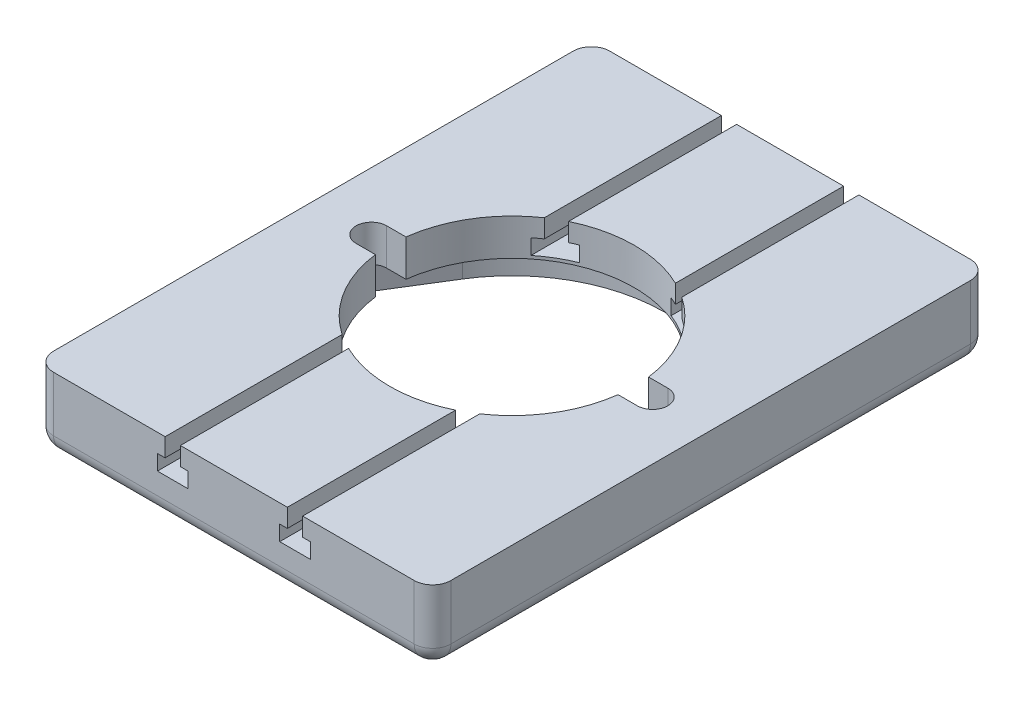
ISO-10303-21;
HEADER;
FILE_DESCRIPTION(('STEP AP214'),'2;1');
FILE_NAME('part.step','',(''),(''),'','','');
FILE_SCHEMA(('AUTOMOTIVE_DESIGN { 1 0 10303 214 1 1 1 1 }'));
ENDSEC;
DATA;
#1=APPLICATION_CONTEXT('core data for automotive mechanical design processes');
#2=APPLICATION_PROTOCOL_DEFINITION('international standard','automotive_design',2000,#1);
#3=PRODUCT_CONTEXT('',#1,'mechanical');
#4=PRODUCT('Part','Part','',(#3));
#5=PRODUCT_RELATED_PRODUCT_CATEGORY('part','',(#4));
#6=PRODUCT_DEFINITION_FORMATION('','',#4);
#7=PRODUCT_DEFINITION_CONTEXT('part definition',#1,'design');
#8=PRODUCT_DEFINITION('design','',#6,#7);
#9=PRODUCT_DEFINITION_SHAPE('','',#8);
#10=(LENGTH_UNIT() NAMED_UNIT(*) SI_UNIT(.MILLI.,.METRE.));
#11=(NAMED_UNIT(*) PLANE_ANGLE_UNIT() SI_UNIT($,.RADIAN.));
#12=(NAMED_UNIT(*) SI_UNIT($,.STERADIAN.) SOLID_ANGLE_UNIT());
#13=UNCERTAINTY_MEASURE_WITH_UNIT(LENGTH_MEASURE(1.E-05),#10,'distance_accuracy_value','');
#14=(GEOMETRIC_REPRESENTATION_CONTEXT(3) GLOBAL_UNCERTAINTY_ASSIGNED_CONTEXT((#13)) GLOBAL_UNIT_ASSIGNED_CONTEXT((#10,
#11,#12)) REPRESENTATION_CONTEXT('',''));
#15=CARTESIAN_POINT('',(0.,0.,0.));
#16=DIRECTION('',(0.,0.,1.));
#17=DIRECTION('',(1.,0.,0.));
#18=AXIS2_PLACEMENT_3D('',#15,#16,#17);
#19=CARTESIAN_POINT('',(0.,0.,0.));
#20=DIRECTION('',(0.,-1.,0.));
#21=DIRECTION('',(0.,0.,-1.));
#22=AXIS2_PLACEMENT_3D('',#19,#20,#21);
#23=PLANE('',#22);
#24=DIRECTION('',(1.,0.,0.));
#25=VECTOR('',#24,1.);
#26=CARTESIAN_POINT('',(-325.,0.,455.));
#27=LINE('',#26,#25);
#28=CARTESIAN_POINT('',(-295.,0.,455.));
#29=VERTEX_POINT('',#28);
#30=CARTESIAN_POINT('',(-112.5,0.,455.));
#31=VERTEX_POINT('',#30);
#32=EDGE_CURVE('E767',#29,#31,#27,.T.);
#33=ORIENTED_EDGE('',*,*,#32,.T.);
#34=DIRECTION('',(0.,0.,-1.));
#35=VECTOR('',#34,1.);
#36=CARTESIAN_POINT('',(-112.5,0.,0.));
#37=LINE('',#36,#35);
#38=CARTESIAN_POINT('',(-112.5,0.,165.359456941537));
#39=VERTEX_POINT('',#38);
#40=EDGE_CURVE('E12',#31,#39,#37,.T.);
#41=ORIENTED_EDGE('',*,*,#40,.T.);
#42=CARTESIAN_POINT('',(0.,0.,0.));
#43=DIRECTION('',(0.,1.,0.));
#44=DIRECTION('',(0.,0.,1.));
#45=AXIS2_PLACEMENT_3D('',#42,#43,#44);
#46=CIRCLE('',#45,200.);
#47=CARTESIAN_POINT('',(-198.431348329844,0.,25.));
#48=VERTEX_POINT('',#47);
#49=EDGE_CURVE('E748',#48,#39,#46,.T.);
#50=ORIENTED_EDGE('',*,*,#49,.F.);
#51=DIRECTION('',(1.,0.,0.));
#52=VECTOR('',#51,1.);
#53=CARTESIAN_POINT('',(-230.,0.,25.));
#54=LINE('',#53,#52);
#55=CARTESIAN_POINT('',(-230.,0.,25.));
#56=VERTEX_POINT('',#55);
#57=EDGE_CURVE('E738',#56,#48,#54,.T.);
#58=ORIENTED_EDGE('',*,*,#57,.F.);
#59=CARTESIAN_POINT('',(-230.,0.,0.));
#60=DIRECTION('',(0.,1.,0.));
#61=DIRECTION('',(0.,0.,1.));
#62=AXIS2_PLACEMENT_3D('',#59,#60,#61);
#63=CIRCLE('',#62,25.);
#64=CARTESIAN_POINT('',(-230.,0.,-25.));
#65=VERTEX_POINT('',#64);
#66=EDGE_CURVE('E735',#65,#56,#63,.T.);
#67=ORIENTED_EDGE('',*,*,#66,.F.);
#68=DIRECTION('',(-1.,0.,0.));
#69=VECTOR('',#68,1.);
#70=CARTESIAN_POINT('',(-230.,0.,-25.));
#71=LINE('',#70,#69);
#72=CARTESIAN_POINT('',(-198.431348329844,0.,-25.));
#73=VERTEX_POINT('',#72);
#74=EDGE_CURVE('E740',#73,#65,#71,.T.);
#75=ORIENTED_EDGE('',*,*,#74,.F.);
#76=CARTESIAN_POINT('',(-112.5,0.,-165.359456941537));
#77=VERTEX_POINT('',#76);
#78=EDGE_CURVE('E746',#77,#73,#46,.T.);
#79=ORIENTED_EDGE('',*,*,#78,.F.);
#80=DIRECTION('',(0.,0.,1.));
#81=VECTOR('',#80,1.);
#82=CARTESIAN_POINT('',(-112.5,0.,-455.));
#83=LINE('',#82,#81);
#84=CARTESIAN_POINT('',(-112.5,0.,-455.));
#85=VERTEX_POINT('',#84);
#86=EDGE_CURVE('E502',#85,#77,#83,.T.);
#87=ORIENTED_EDGE('',*,*,#86,.F.);
#88=DIRECTION('',(-1.,0.,0.));
#89=VECTOR('',#88,1.);
#90=CARTESIAN_POINT('',(-325.,0.,-455.));
#91=LINE('',#90,#89);
#92=CARTESIAN_POINT('',(-295.,0.,-455.));
#93=VERTEX_POINT('',#92);
#94=EDGE_CURVE('E757',#85,#93,#91,.T.);
#95=ORIENTED_EDGE('',*,*,#94,.T.);
#96=CARTESIAN_POINT('',(-295.,0.,-425.));
#97=DIRECTION('',(0.,-1.,0.));
#98=DIRECTION('',(0.,0.,-1.));
#99=AXIS2_PLACEMENT_3D('',#96,#97,#98);
#100=CIRCLE('',#99,30.);
#101=CARTESIAN_POINT('',(-325.,0.,-425.));
#102=VERTEX_POINT('',#101);
#103=EDGE_CURVE('E813',#93,#102,#100,.F.);
#104=ORIENTED_EDGE('',*,*,#103,.T.);
#105=DIRECTION('',(0.,0.,1.));
#106=VECTOR('',#105,1.);
#107=CARTESIAN_POINT('',(-325.,0.,455.));
#108=LINE('',#107,#106);
#109=CARTESIAN_POINT('',(-325.,0.,425.));
#110=VERTEX_POINT('',#109);
#111=EDGE_CURVE('E762',#102,#110,#108,.T.);
#112=ORIENTED_EDGE('',*,*,#111,.T.);
#113=CARTESIAN_POINT('',(-295.,0.,425.));
#114=DIRECTION('',(0.,-1.,0.));
#115=DIRECTION('',(0.,0.,-1.));
#116=AXIS2_PLACEMENT_3D('',#113,#114,#115);
#117=CIRCLE('',#116,30.);
#118=EDGE_CURVE('E807',#110,#29,#117,.F.);
#119=ORIENTED_EDGE('',*,*,#118,.T.);
#120=EDGE_LOOP('',(#33,#41,#50,#58,#67,#75,#79,#87,#95,#104,#112,#119));
#121=FACE_BOUND('',#120,.T.);
#122=ADVANCED_FACE('F38',(#121),#23,.F.);
#123=CARTESIAN_POINT('',(87.5,0.,-455.));
#124=VERTEX_POINT('',#123);
#125=CARTESIAN_POINT('',(-87.5000000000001,0.,-455.));
#126=VERTEX_POINT('',#125);
#127=EDGE_CURVE('E763',#124,#126,#91,.T.);
#128=ORIENTED_EDGE('',*,*,#127,.T.);
#129=DIRECTION('',(0.,0.,1.));
#130=VECTOR('',#129,1.);
#131=CARTESIAN_POINT('',(-87.5000000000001,0.,-455.));
#132=LINE('',#131,#130);
#133=CARTESIAN_POINT('',(-87.5000000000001,0.,-179.843682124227));
#134=VERTEX_POINT('',#133);
#135=EDGE_CURVE('E436',#126,#134,#132,.T.);
#136=ORIENTED_EDGE('',*,*,#135,.T.);
#137=CARTESIAN_POINT('',(87.5,0.,-179.843682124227));
#138=VERTEX_POINT('',#137);
#139=EDGE_CURVE('E957',#138,#134,#46,.T.);
#140=ORIENTED_EDGE('',*,*,#139,.F.);
#141=DIRECTION('',(0.,0.,1.));
#142=VECTOR('',#141,1.);
#143=CARTESIAN_POINT('',(87.5,0.,-455.));
#144=LINE('',#143,#142);
#145=EDGE_CURVE('E610',#124,#138,#144,.T.);
#146=ORIENTED_EDGE('',*,*,#145,.F.);
#147=EDGE_LOOP('',(#128,#136,#140,#146));
#148=FACE_BOUND('',#147,.T.);
#149=ADVANCED_FACE('F1004',(#148),#23,.F.);
#150=CARTESIAN_POINT('',(295.,0.,-455.));
#151=VERTEX_POINT('',#150);
#152=CARTESIAN_POINT('',(112.5,0.,-455.));
#153=VERTEX_POINT('',#152);
#154=EDGE_CURVE('E759',#151,#153,#91,.T.);
#155=ORIENTED_EDGE('',*,*,#154,.T.);
#156=DIRECTION('',(0.,0.,1.));
#157=VECTOR('',#156,1.);
#158=CARTESIAN_POINT('',(112.5,0.,-455.));
#159=LINE('',#158,#157);
#160=CARTESIAN_POINT('',(112.5,0.,-165.359456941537));
#161=VERTEX_POINT('',#160);
#162=EDGE_CURVE('E566',#153,#161,#159,.T.);
#163=ORIENTED_EDGE('',*,*,#162,.T.);
#164=CARTESIAN_POINT('',(198.431348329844,0.,-25.0000000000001));
#165=VERTEX_POINT('',#164);
#166=EDGE_CURVE('E753',#165,#161,#46,.T.);
#167=ORIENTED_EDGE('',*,*,#166,.F.);
#168=DIRECTION('',(-1.,0.,0.));
#169=VECTOR('',#168,1.);
#170=CARTESIAN_POINT('',(-230.,0.,-25.));
#171=LINE('',#170,#169);
#172=CARTESIAN_POINT('',(230.,0.,-25.0000000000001));
#173=VERTEX_POINT('',#172);
#174=EDGE_CURVE('E719',#173,#165,#171,.T.);
#175=ORIENTED_EDGE('',*,*,#174,.F.);
#176=CARTESIAN_POINT('',(230.,0.,0.));
#177=DIRECTION('',(0.,1.,0.));
#178=DIRECTION('',(0.,0.,1.));
#179=AXIS2_PLACEMENT_3D('',#176,#177,#178);
#180=CIRCLE('',#179,25.);
#181=CARTESIAN_POINT('',(230.,0.,24.9999999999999));
#182=VERTEX_POINT('',#181);
#183=EDGE_CURVE('E720',#182,#173,#180,.T.);
#184=ORIENTED_EDGE('',*,*,#183,.F.);
#185=DIRECTION('',(1.,0.,0.));
#186=VECTOR('',#185,1.);
#187=CARTESIAN_POINT('',(-230.,0.,25.));
#188=LINE('',#187,#186);
#189=CARTESIAN_POINT('',(198.431348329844,0.,24.9999999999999));
#190=VERTEX_POINT('',#189);
#191=EDGE_CURVE('E714',#190,#182,#188,.T.);
#192=ORIENTED_EDGE('',*,*,#191,.F.);
#193=CARTESIAN_POINT('',(112.5,0.,165.359456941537));
#194=VERTEX_POINT('',#193);
#195=EDGE_CURVE('E956',#194,#190,#46,.T.);
#196=ORIENTED_EDGE('',*,*,#195,.F.);
#197=DIRECTION('',(0.,0.,1.));
#198=VECTOR('',#197,1.);
#199=CARTESIAN_POINT('',(112.5,0.,0.));
#200=LINE('',#199,#198);
#201=CARTESIAN_POINT('',(112.5,0.,455.));
#202=VERTEX_POINT('',#201);
#203=EDGE_CURVE('E906',#194,#202,#200,.T.);
#204=ORIENTED_EDGE('',*,*,#203,.T.);
#205=CARTESIAN_POINT('',(295.,0.,455.));
#206=VERTEX_POINT('',#205);
#207=EDGE_CURVE('E766',#202,#206,#27,.T.);
#208=ORIENTED_EDGE('',*,*,#207,.T.);
#209=CARTESIAN_POINT('',(295.,0.,425.));
#210=DIRECTION('',(0.,-1.,0.));
#211=DIRECTION('',(0.,0.,-1.));
#212=AXIS2_PLACEMENT_3D('',#209,#210,#211);
#213=CIRCLE('',#212,30.);
#214=CARTESIAN_POINT('',(325.,0.,425.));
#215=VERTEX_POINT('',#214);
#216=EDGE_CURVE('E809',#206,#215,#213,.F.);
#217=ORIENTED_EDGE('',*,*,#216,.T.);
#218=DIRECTION('',(0.,0.,-1.));
#219=VECTOR('',#218,1.);
#220=CARTESIAN_POINT('',(325.,0.,455.));
#221=LINE('',#220,#219);
#222=CARTESIAN_POINT('',(325.,0.,-425.));
#223=VERTEX_POINT('',#222);
#224=EDGE_CURVE('E754',#215,#223,#221,.T.);
#225=ORIENTED_EDGE('',*,*,#224,.T.);
#226=CARTESIAN_POINT('',(295.,0.,-425.));
#227=DIRECTION('',(0.,-1.,0.));
#228=DIRECTION('',(0.,0.,-1.));
#229=AXIS2_PLACEMENT_3D('',#226,#227,#228);
#230=CIRCLE('',#229,30.);
#231=EDGE_CURVE('E811',#223,#151,#230,.F.);
#232=ORIENTED_EDGE('',*,*,#231,.T.);
#233=EDGE_LOOP('',(#155,#163,#167,#175,#184,#192,#196,#204,#208,#217,#225,#232));
#234=FACE_BOUND('',#233,.T.);
#235=ADVANCED_FACE('F921',(#234),#23,.F.);
#236=CARTESIAN_POINT('',(0.,-120.001,0.));
#237=DIRECTION('',(0.,1.,0.));
#238=DIRECTION('',(0.,0.,1.));
#239=AXIS2_PLACEMENT_3D('',#236,#237,#238);
#240=CYLINDRICAL_SURFACE('',#239,200.);
#241=ORIENTED_EDGE('',*,*,#49,.T.);
#242=DIRECTION('',(0.,1.,0.));
#243=VECTOR('',#242,1.);
#244=CARTESIAN_POINT('',(-112.5,-120.001,165.359456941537));
#245=LINE('',#244,#243);
#246=CARTESIAN_POINT('',(-112.5,-29.9999999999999,165.359456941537));
#247=VERTEX_POINT('',#246);
#248=EDGE_CURVE('E512',#39,#247,#245,.F.);
#249=ORIENTED_EDGE('',*,*,#248,.T.);
#250=CARTESIAN_POINT('',(0.,-29.9999999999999,0.));
#251=DIRECTION('',(0.,1.,0.));
#252=DIRECTION('',(-1.,0.,0.));
#253=AXIS2_PLACEMENT_3D('',#250,#251,#252);
#254=CIRCLE('',#253,200.);
#255=CARTESIAN_POINT('',(-125.,-29.9999999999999,156.12494995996));
#256=VERTEX_POINT('',#255);
#257=EDGE_CURVE('E518',#247,#256,#254,.F.);
#258=ORIENTED_EDGE('',*,*,#257,.T.);
#259=DIRECTION('',(0.,1.,0.));
#260=VECTOR('',#259,1.);
#261=CARTESIAN_POINT('',(-125.,-120.001,156.12494995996));
#262=LINE('',#261,#260);
#263=CARTESIAN_POINT('',(-125.,-54.9999999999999,156.12494995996));
#264=VERTEX_POINT('',#263);
#265=EDGE_CURVE('E524',#256,#264,#262,.F.);
#266=ORIENTED_EDGE('',*,*,#265,.T.);
#267=CARTESIAN_POINT('',(0.,-54.9999999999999,0.));
#268=DIRECTION('',(0.,-1.,0.));
#269=DIRECTION('',(1.,0.,0.));
#270=AXIS2_PLACEMENT_3D('',#267,#268,#269);
#271=CIRCLE('',#270,200.);
#272=CARTESIAN_POINT('',(-75.0000000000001,-54.9999999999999,185.404962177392));
#273=VERTEX_POINT('',#272);
#274=EDGE_CURVE('E530',#264,#273,#271,.F.);
#275=ORIENTED_EDGE('',*,*,#274,.T.);
#276=DIRECTION('',(0.,1.,0.));
#277=VECTOR('',#276,1.);
#278=CARTESIAN_POINT('',(-75.0000000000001,-120.001,185.404962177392));
#279=LINE('',#278,#277);
#280=CARTESIAN_POINT('',(-75.0000000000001,-29.9999999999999,185.404962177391));
#281=VERTEX_POINT('',#280);
#282=EDGE_CURVE('E536',#273,#281,#279,.T.);
#283=ORIENTED_EDGE('',*,*,#282,.T.);
#284=CARTESIAN_POINT('',(0.,-29.9999999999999,0.));
#285=DIRECTION('',(0.,1.,0.));
#286=DIRECTION('',(0.,0.,1.));
#287=AXIS2_PLACEMENT_3D('',#284,#285,#286);
#288=CIRCLE('',#287,200.);
#289=CARTESIAN_POINT('',(-87.5000000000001,-29.9999999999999,179.843682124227));
#290=VERTEX_POINT('',#289);
#291=EDGE_CURVE('E540',#281,#290,#288,.F.);
#292=ORIENTED_EDGE('',*,*,#291,.T.);
#293=DIRECTION('',(0.,1.,0.));
#294=VECTOR('',#293,1.);
#295=CARTESIAN_POINT('',(-87.5000000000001,-120.001,179.843682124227));
#296=LINE('',#295,#294);
#297=CARTESIAN_POINT('',(-87.5000000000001,0.,179.843682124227));
#298=VERTEX_POINT('',#297);
#299=EDGE_CURVE('E506',#290,#298,#296,.T.);
#300=ORIENTED_EDGE('',*,*,#299,.T.);
#301=CARTESIAN_POINT('',(87.5,0.,179.843682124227));
#302=VERTEX_POINT('',#301);
#303=EDGE_CURVE('E752',#298,#302,#46,.T.);
#304=ORIENTED_EDGE('',*,*,#303,.T.);
#305=DIRECTION('',(0.,1.,0.));
#306=VECTOR('',#305,1.);
#307=CARTESIAN_POINT('',(87.5,-120.001,179.843682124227));
#308=LINE('',#307,#306);
#309=CARTESIAN_POINT('',(87.5,-29.9999999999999,179.843682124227));
#310=VERTEX_POINT('',#309);
#311=EDGE_CURVE('E616',#302,#310,#308,.F.);
#312=ORIENTED_EDGE('',*,*,#311,.T.);
#313=CARTESIAN_POINT('',(0.,-29.9999999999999,0.));
#314=DIRECTION('',(0.,1.,0.));
#315=DIRECTION('',(0.,0.,1.));
#316=AXIS2_PLACEMENT_3D('',#313,#314,#315);
#317=CIRCLE('',#316,200.);
#318=CARTESIAN_POINT('',(75.,-29.9999999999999,185.404962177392));
#319=VERTEX_POINT('',#318);
#320=EDGE_CURVE('E628',#310,#319,#317,.F.);
#321=ORIENTED_EDGE('',*,*,#320,.T.);
#322=DIRECTION('',(0.,1.,0.));
#323=VECTOR('',#322,1.);
#324=CARTESIAN_POINT('',(75.,-120.001,185.404962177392));
#325=LINE('',#324,#323);
#326=CARTESIAN_POINT('',(75.,-54.9999999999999,185.404962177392));
#327=VERTEX_POINT('',#326);
#328=EDGE_CURVE('E634',#319,#327,#325,.F.);
#329=ORIENTED_EDGE('',*,*,#328,.T.);
#330=CARTESIAN_POINT('',(0.,-54.9999999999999,0.));
#331=DIRECTION('',(0.,-1.,0.));
#332=DIRECTION('',(1.,0.,0.));
#333=AXIS2_PLACEMENT_3D('',#330,#331,#332);
#334=CIRCLE('',#333,200.);
#335=CARTESIAN_POINT('',(125.,-54.9999999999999,156.12494995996));
#336=VERTEX_POINT('',#335);
#337=EDGE_CURVE('E640',#327,#336,#334,.F.);
#338=ORIENTED_EDGE('',*,*,#337,.T.);
#339=DIRECTION('',(0.,1.,0.));
#340=VECTOR('',#339,1.);
#341=CARTESIAN_POINT('',(125.,-120.001,156.12494995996));
#342=LINE('',#341,#340);
#343=CARTESIAN_POINT('',(125.,-29.9999999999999,156.12494995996));
#344=VERTEX_POINT('',#343);
#345=EDGE_CURVE('E646',#336,#344,#342,.T.);
#346=ORIENTED_EDGE('',*,*,#345,.T.);
#347=CARTESIAN_POINT('',(0.,-29.9999999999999,0.));
#348=DIRECTION('',(0.,1.,0.));
#349=DIRECTION('',(-1.,0.,0.));
#350=AXIS2_PLACEMENT_3D('',#347,#348,#349);
#351=CIRCLE('',#350,200.);
#352=CARTESIAN_POINT('',(112.5,-29.9999999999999,165.359456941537));
#353=VERTEX_POINT('',#352);
#354=EDGE_CURVE('E652',#344,#353,#351,.F.);
#355=ORIENTED_EDGE('',*,*,#354,.T.);
#356=DIRECTION('',(0.,1.,0.));
#357=VECTOR('',#356,1.);
#358=CARTESIAN_POINT('',(112.5,-120.001,165.359456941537));
#359=LINE('',#358,#357);
#360=EDGE_CURVE('E622',#353,#194,#359,.T.);
#361=ORIENTED_EDGE('',*,*,#360,.T.);
#362=ORIENTED_EDGE('',*,*,#195,.T.);
#363=DIRECTION('',(0.,1.,0.));
#364=VECTOR('',#363,1.);
#365=CARTESIAN_POINT('',(198.431348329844,-120.001,24.9999999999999));
#366=LINE('',#365,#364);
#367=CARTESIAN_POINT('',(198.431348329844,-60.,24.9999999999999));
#368=VERTEX_POINT('',#367);
#369=EDGE_CURVE('E715',#368,#190,#366,.T.);
#370=ORIENTED_EDGE('',*,*,#369,.F.);
#371=CARTESIAN_POINT('',(0.,-60.,0.));
#372=DIRECTION('',(0.,-1.,0.));
#373=DIRECTION('',(0.,0.,-1.));
#374=AXIS2_PLACEMENT_3D('',#371,#372,#373);
#375=CIRCLE('',#374,200.);
#376=CARTESIAN_POINT('',(-198.431348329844,-60.,25.));
#377=VERTEX_POINT('',#376);
#378=EDGE_CURVE('E703',#377,#368,#375,.F.);
#379=ORIENTED_EDGE('',*,*,#378,.F.);
#380=DIRECTION('',(0.,1.,0.));
#381=VECTOR('',#380,1.);
#382=CARTESIAN_POINT('',(-198.431348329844,-120.001,25.));
#383=LINE('',#382,#381);
#384=EDGE_CURVE('E718',#48,#377,#383,.F.);
#385=ORIENTED_EDGE('',*,*,#384,.F.);
#386=EDGE_LOOP('',(#241,#249,#258,#266,#275,#283,#292,#300,#304,#312,#321,#329,#338,#346,#355,
#361,#362,#370,#379,#385));
#387=FACE_BOUND('',#386,.T.);
#388=ADVANCED_FACE('F962',(#387),#240,.F.);
#389=CARTESIAN_POINT('',(0.,-29.9999999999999,0.));
#390=DIRECTION('',(0.,1.,0.));
#391=DIRECTION('',(-1.,0.,0.));
#392=AXIS2_PLACEMENT_3D('',#389,#390,#391);
#393=CIRCLE('',#392,200.);
#394=CARTESIAN_POINT('',(-125.,-29.9999999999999,-156.12494995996));
#395=VERTEX_POINT('',#394);
#396=CARTESIAN_POINT('',(-112.5,-29.9999999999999,-165.359456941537));
#397=VERTEX_POINT('',#396);
#398=EDGE_CURVE('E515',#395,#397,#393,.F.);
#399=ORIENTED_EDGE('',*,*,#398,.T.);
#400=DIRECTION('',(0.,1.,0.));
#401=VECTOR('',#400,1.);
#402=CARTESIAN_POINT('',(-112.5,-120.001,-165.359456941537));
#403=LINE('',#402,#401);
#404=EDGE_CURVE('E509',#397,#77,#403,.T.);
#405=ORIENTED_EDGE('',*,*,#404,.T.);
#406=ORIENTED_EDGE('',*,*,#78,.T.);
#407=DIRECTION('',(0.,1.,0.));
#408=VECTOR('',#407,1.);
#409=CARTESIAN_POINT('',(-198.431348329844,-120.001,-25.));
#410=LINE('',#409,#408);
#411=CARTESIAN_POINT('',(-198.431348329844,-60.,-25.));
#412=VERTEX_POINT('',#411);
#413=EDGE_CURVE('E732',#412,#73,#410,.T.);
#414=ORIENTED_EDGE('',*,*,#413,.F.);
#415=CARTESIAN_POINT('',(0.,-60.,0.));
#416=DIRECTION('',(0.,-1.,0.));
#417=DIRECTION('',(0.,0.,-1.));
#418=AXIS2_PLACEMENT_3D('',#415,#416,#417);
#419=CIRCLE('',#418,200.);
#420=CARTESIAN_POINT('',(198.431348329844,-60.,-25.0000000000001));
#421=VERTEX_POINT('',#420);
#422=EDGE_CURVE('E701',#421,#412,#419,.F.);
#423=ORIENTED_EDGE('',*,*,#422,.F.);
#424=DIRECTION('',(0.,1.,0.));
#425=VECTOR('',#424,1.);
#426=CARTESIAN_POINT('',(198.431348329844,-120.001,-25.0000000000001));
#427=LINE('',#426,#425);
#428=EDGE_CURVE('E711',#165,#421,#427,.F.);
#429=ORIENTED_EDGE('',*,*,#428,.F.);
#430=ORIENTED_EDGE('',*,*,#166,.T.);
#431=DIRECTION('',(0.,1.,0.));
#432=VECTOR('',#431,1.);
#433=CARTESIAN_POINT('',(112.5,-120.001,-165.359456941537));
#434=LINE('',#433,#432);
#435=CARTESIAN_POINT('',(112.5,-29.9999999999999,-165.359456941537));
#436=VERTEX_POINT('',#435);
#437=EDGE_CURVE('E619',#161,#436,#434,.F.);
#438=ORIENTED_EDGE('',*,*,#437,.T.);
#439=CARTESIAN_POINT('',(0.,-29.9999999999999,0.));
#440=DIRECTION('',(0.,1.,0.));
#441=DIRECTION('',(-1.,0.,0.));
#442=AXIS2_PLACEMENT_3D('',#439,#440,#441);
#443=CIRCLE('',#442,200.);
#444=CARTESIAN_POINT('',(125.,-29.9999999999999,-156.12494995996));
#445=VERTEX_POINT('',#444);
#446=EDGE_CURVE('E649',#436,#445,#443,.F.);
#447=ORIENTED_EDGE('',*,*,#446,.T.);
#448=DIRECTION('',(0.,1.,0.));
#449=VECTOR('',#448,1.);
#450=CARTESIAN_POINT('',(125.,-120.001,-156.12494995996));
#451=LINE('',#450,#449);
#452=CARTESIAN_POINT('',(125.,-54.9999999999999,-156.12494995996));
#453=VERTEX_POINT('',#452);
#454=EDGE_CURVE('E643',#445,#453,#451,.F.);
#455=ORIENTED_EDGE('',*,*,#454,.T.);
#456=CARTESIAN_POINT('',(0.,-54.9999999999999,0.));
#457=DIRECTION('',(0.,-1.,0.));
#458=DIRECTION('',(1.,0.,0.));
#459=AXIS2_PLACEMENT_3D('',#456,#457,#458);
#460=CIRCLE('',#459,200.);
#461=CARTESIAN_POINT('',(75.,-54.9999999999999,-185.404962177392));
#462=VERTEX_POINT('',#461);
#463=EDGE_CURVE('E637',#453,#462,#460,.F.);
#464=ORIENTED_EDGE('',*,*,#463,.T.);
#465=DIRECTION('',(0.,1.,0.));
#466=VECTOR('',#465,1.);
#467=CARTESIAN_POINT('',(75.,-120.001,-185.404962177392));
#468=LINE('',#467,#466);
#469=CARTESIAN_POINT('',(75.,-29.9999999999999,-185.404962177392));
#470=VERTEX_POINT('',#469);
#471=EDGE_CURVE('E631',#462,#470,#468,.T.);
#472=ORIENTED_EDGE('',*,*,#471,.T.);
#473=CARTESIAN_POINT('',(0.,-29.9999999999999,0.));
#474=DIRECTION('',(0.,1.,0.));
#475=DIRECTION('',(0.,0.,1.));
#476=AXIS2_PLACEMENT_3D('',#473,#474,#475);
#477=CIRCLE('',#476,200.);
#478=CARTESIAN_POINT('',(87.5,-29.9999999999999,-179.843682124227));
#479=VERTEX_POINT('',#478);
#480=EDGE_CURVE('E625',#470,#479,#477,.F.);
#481=ORIENTED_EDGE('',*,*,#480,.T.);
#482=DIRECTION('',(0.,1.,0.));
#483=VECTOR('',#482,1.);
#484=CARTESIAN_POINT('',(87.5,-120.001,-179.843682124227));
#485=LINE('',#484,#483);
#486=EDGE_CURVE('E588',#479,#138,#485,.T.);
#487=ORIENTED_EDGE('',*,*,#486,.T.);
#488=ORIENTED_EDGE('',*,*,#139,.T.);
#489=DIRECTION('',(0.,1.,0.));
#490=VECTOR('',#489,1.);
#491=CARTESIAN_POINT('',(-87.5000000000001,-120.001,-179.843682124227));
#492=LINE('',#491,#490);
#493=CARTESIAN_POINT('',(-87.5000000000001,-29.9999999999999,-179.843682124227));
#494=VERTEX_POINT('',#493);
#495=EDGE_CURVE('E53',#134,#494,#492,.F.);
#496=ORIENTED_EDGE('',*,*,#495,.T.);
#497=CARTESIAN_POINT('',(0.,-29.9999999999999,0.));
#498=DIRECTION('',(0.,1.,0.));
#499=DIRECTION('',(0.,0.,1.));
#500=AXIS2_PLACEMENT_3D('',#497,#498,#499);
#501=CIRCLE('',#500,200.);
#502=CARTESIAN_POINT('',(-75.0000000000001,-29.9999999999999,-185.404962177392));
#503=VERTEX_POINT('',#502);
#504=EDGE_CURVE('E435',#494,#503,#501,.F.);
#505=ORIENTED_EDGE('',*,*,#504,.T.);
#506=DIRECTION('',(0.,1.,0.));
#507=VECTOR('',#506,1.);
#508=CARTESIAN_POINT('',(-75.0000000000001,-120.001,-185.404962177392));
#509=LINE('',#508,#507);
#510=CARTESIAN_POINT('',(-75.0000000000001,-54.9999999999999,-185.404962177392));
#511=VERTEX_POINT('',#510);
#512=EDGE_CURVE('E533',#503,#511,#509,.F.);
#513=ORIENTED_EDGE('',*,*,#512,.T.);
#514=CARTESIAN_POINT('',(0.,-54.9999999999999,0.));
#515=DIRECTION('',(0.,-1.,0.));
#516=DIRECTION('',(1.,0.,0.));
#517=AXIS2_PLACEMENT_3D('',#514,#515,#516);
#518=CIRCLE('',#517,200.);
#519=CARTESIAN_POINT('',(-125.,-54.9999999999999,-156.12494995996));
#520=VERTEX_POINT('',#519);
#521=EDGE_CURVE('E527',#511,#520,#518,.F.);
#522=ORIENTED_EDGE('',*,*,#521,.T.);
#523=DIRECTION('',(0.,1.,0.));
#524=VECTOR('',#523,1.);
#525=CARTESIAN_POINT('',(-125.,-120.001,-156.12494995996));
#526=LINE('',#525,#524);
#527=EDGE_CURVE('E521',#520,#395,#526,.T.);
#528=ORIENTED_EDGE('',*,*,#527,.T.);
#529=EDGE_LOOP('',(#399,#405,#406,#414,#423,#429,#430,#438,#447,#455,#464,#472,#481,#487,#488,
#496,#505,#513,#522,#528));
#530=FACE_BOUND('',#529,.T.);
#531=ADVANCED_FACE('F954',(#530),#240,.F.);
#532=CARTESIAN_POINT('',(-230.,-120.001,25.));
#533=DIRECTION('',(0.,0.,1.));
#534=DIRECTION('',(1.,0.,0.));
#535=AXIS2_PLACEMENT_3D('',#532,#533,#534);
#536=PLANE('',#535);
#537=DIRECTION('',(1.,0.,0.));
#538=VECTOR('',#537,1.);
#539=CARTESIAN_POINT('',(-230.,-60.,25.));
#540=LINE('',#539,#538);
#541=CARTESIAN_POINT('',(-230.,-60.,25.));
#542=VERTEX_POINT('',#541);
#543=EDGE_CURVE('E707',#542,#377,#540,.T.);
#544=ORIENTED_EDGE('',*,*,#543,.F.);
#545=DIRECTION('',(0.,1.,0.));
#546=VECTOR('',#545,1.);
#547=CARTESIAN_POINT('',(-230.,-120.001,25.));
#548=LINE('',#547,#546);
#549=EDGE_CURVE('E743',#542,#56,#548,.T.);
#550=ORIENTED_EDGE('',*,*,#549,.T.);
#551=ORIENTED_EDGE('',*,*,#57,.T.);
#552=ORIENTED_EDGE('',*,*,#384,.T.);
#553=EDGE_LOOP('',(#544,#550,#551,#552));
#554=FACE_BOUND('',#553,.T.);
#555=ADVANCED_FACE('F1030',(#554),#536,.F.);
#556=CARTESIAN_POINT('',(-230.,-120.001,-25.));
#557=DIRECTION('',(0.,0.,-1.));
#558=DIRECTION('',(-1.,0.,0.));
#559=AXIS2_PLACEMENT_3D('',#556,#557,#558);
#560=PLANE('',#559);
#561=DIRECTION('',(-1.,0.,0.));
#562=VECTOR('',#561,1.);
#563=CARTESIAN_POINT('',(-230.,-60.,-25.));
#564=LINE('',#563,#562);
#565=CARTESIAN_POINT('',(-230.,-60.,-25.));
#566=VERTEX_POINT('',#565);
#567=EDGE_CURVE('E705',#412,#566,#564,.T.);
#568=ORIENTED_EDGE('',*,*,#567,.F.);
#569=ORIENTED_EDGE('',*,*,#413,.T.);
#570=ORIENTED_EDGE('',*,*,#74,.T.);
#571=DIRECTION('',(0.,1.,0.));
#572=VECTOR('',#571,1.);
#573=CARTESIAN_POINT('',(-230.,-120.001,-25.));
#574=LINE('',#573,#572);
#575=EDGE_CURVE('E744',#566,#65,#574,.T.);
#576=ORIENTED_EDGE('',*,*,#575,.F.);
#577=EDGE_LOOP('',(#568,#569,#570,#576));
#578=FACE_BOUND('',#577,.T.);
#579=ADVANCED_FACE('F1036',(#578),#560,.F.);
#580=CARTESIAN_POINT('',(-230.,-120.001,0.));
#581=DIRECTION('',(0.,1.,0.));
#582=DIRECTION('',(0.,0.,1.));
#583=AXIS2_PLACEMENT_3D('',#580,#581,#582);
#584=CYLINDRICAL_SURFACE('',#583,25.);
#585=CARTESIAN_POINT('',(-230.,-60.,0.));
#586=DIRECTION('',(0.,-1.,0.));
#587=DIRECTION('',(0.,0.,-1.));
#588=AXIS2_PLACEMENT_3D('',#585,#586,#587);
#589=CIRCLE('',#588,25.);
#590=EDGE_CURVE('E709',#566,#542,#589,.F.);
#591=ORIENTED_EDGE('',*,*,#590,.F.);
#592=ORIENTED_EDGE('',*,*,#575,.T.);
#593=ORIENTED_EDGE('',*,*,#66,.T.);
#594=ORIENTED_EDGE('',*,*,#549,.F.);
#595=EDGE_LOOP('',(#591,#592,#593,#594));
#596=FACE_BOUND('',#595,.T.);
#597=ADVANCED_FACE('F1032',(#596),#584,.F.);
#598=CARTESIAN_POINT('',(-230.,-120.001,25.));
#599=DIRECTION('',(0.,0.,1.));
#600=DIRECTION('',(1.,0.,0.));
#601=AXIS2_PLACEMENT_3D('',#598,#599,#600);
#602=PLANE('',#601);
#603=DIRECTION('',(1.,0.,0.));
#604=VECTOR('',#603,1.);
#605=CARTESIAN_POINT('',(-230.,-60.,25.));
#606=LINE('',#605,#604);
#607=CARTESIAN_POINT('',(230.,-60.,24.9999999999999));
#608=VERTEX_POINT('',#607);
#609=EDGE_CURVE('E699',#368,#608,#606,.T.);
#610=ORIENTED_EDGE('',*,*,#609,.F.);
#611=ORIENTED_EDGE('',*,*,#369,.T.);
#612=ORIENTED_EDGE('',*,*,#191,.T.);
#613=DIRECTION('',(0.,1.,0.));
#614=VECTOR('',#613,1.);
#615=CARTESIAN_POINT('',(230.,-120.001,24.9999999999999));
#616=LINE('',#615,#614);
#617=EDGE_CURVE('E712',#608,#182,#616,.T.);
#618=ORIENTED_EDGE('',*,*,#617,.F.);
#619=EDGE_LOOP('',(#610,#611,#612,#618));
#620=FACE_BOUND('',#619,.T.);
#621=ADVANCED_FACE('F1035',(#620),#602,.F.);
#622=CARTESIAN_POINT('',(-230.,-120.001,-25.));
#623=DIRECTION('',(0.,0.,-1.));
#624=DIRECTION('',(-1.,0.,0.));
#625=AXIS2_PLACEMENT_3D('',#622,#623,#624);
#626=PLANE('',#625);
#627=DIRECTION('',(-1.,0.,0.));
#628=VECTOR('',#627,1.);
#629=CARTESIAN_POINT('',(-230.,-60.,-25.));
#630=LINE('',#629,#628);
#631=CARTESIAN_POINT('',(230.,-60.,-25.0000000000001));
#632=VERTEX_POINT('',#631);
#633=EDGE_CURVE('E684',#632,#421,#630,.T.);
#634=ORIENTED_EDGE('',*,*,#633,.F.);
#635=DIRECTION('',(0.,1.,0.));
#636=VECTOR('',#635,1.);
#637=CARTESIAN_POINT('',(230.,-120.001,-25.0000000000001));
#638=LINE('',#637,#636);
#639=EDGE_CURVE('E716',#632,#173,#638,.T.);
#640=ORIENTED_EDGE('',*,*,#639,.T.);
#641=ORIENTED_EDGE('',*,*,#174,.T.);
#642=ORIENTED_EDGE('',*,*,#428,.T.);
#643=EDGE_LOOP('',(#634,#640,#641,#642));
#644=FACE_BOUND('',#643,.T.);
#645=ADVANCED_FACE('F1044',(#644),#626,.F.);
#646=CARTESIAN_POINT('',(230.,-120.001,0.));
#647=DIRECTION('',(0.,1.,0.));
#648=DIRECTION('',(0.,0.,1.));
#649=AXIS2_PLACEMENT_3D('',#646,#647,#648);
#650=CYLINDRICAL_SURFACE('',#649,25.);
#651=CARTESIAN_POINT('',(230.,-60.,0.));
#652=DIRECTION('',(0.,-1.,0.));
#653=DIRECTION('',(0.,0.,-1.));
#654=AXIS2_PLACEMENT_3D('',#651,#652,#653);
#655=CIRCLE('',#654,25.);
#656=EDGE_CURVE('E815',#608,#632,#655,.F.);
#657=ORIENTED_EDGE('',*,*,#656,.F.);
#658=ORIENTED_EDGE('',*,*,#617,.T.);
#659=ORIENTED_EDGE('',*,*,#183,.T.);
#660=ORIENTED_EDGE('',*,*,#639,.F.);
#661=EDGE_LOOP('',(#657,#658,#659,#660));
#662=FACE_BOUND('',#661,.T.);
#663=ADVANCED_FACE('F1047',(#662),#650,.F.);
#664=CARTESIAN_POINT('',(325.,-120.,455.));
#665=DIRECTION('',(1.,0.,0.));
#666=DIRECTION('',(0.,0.,-1.));
#667=AXIS2_PLACEMENT_3D('',#664,#665,#666);
#668=PLANE('',#667);
#669=DIRECTION('',(0.,0.,-1.));
#670=VECTOR('',#669,1.);
#671=CARTESIAN_POINT('',(325.,-90.,455.));
#672=LINE('',#671,#670);
#673=CARTESIAN_POINT('',(325.,-90.,425.));
#674=VERTEX_POINT('',#673);
#675=CARTESIAN_POINT('',(325.,-90.,-425.));
#676=VERTEX_POINT('',#675);
#677=EDGE_CURVE('E803',#674,#676,#672,.T.);
#678=ORIENTED_EDGE('',*,*,#677,.T.);
#679=DIRECTION('',(0.,1.,0.));
#680=VECTOR('',#679,1.);
#681=CARTESIAN_POINT('',(325.,-120.,-425.));
#682=LINE('',#681,#680);
#683=EDGE_CURVE('E805',#676,#223,#682,.T.);
#684=ORIENTED_EDGE('',*,*,#683,.T.);
#685=ORIENTED_EDGE('',*,*,#224,.F.);
#686=DIRECTION('',(0.,1.,0.));
#687=VECTOR('',#686,1.);
#688=CARTESIAN_POINT('',(325.,-120.,425.));
#689=LINE('',#688,#687);
#690=EDGE_CURVE('E801',#215,#674,#689,.F.);
#691=ORIENTED_EDGE('',*,*,#690,.T.);
#692=EDGE_LOOP('',(#678,#684,#685,#691));
#693=FACE_BOUND('',#692,.T.);
#694=ADVANCED_FACE('F935',(#693),#668,.T.);
#695=CARTESIAN_POINT('',(-325.,-120.,455.));
#696=DIRECTION('',(0.,0.,1.));
#697=DIRECTION('',(1.,0.,0.));
#698=AXIS2_PLACEMENT_3D('',#695,#696,#697);
#699=PLANE('',#698);
#700=DIRECTION('',(0.,-1.,0.));
#701=VECTOR('',#700,1.);
#702=CARTESIAN_POINT('',(-112.5,0.,455.));
#703=LINE('',#702,#701);
#704=CARTESIAN_POINT('',(-112.5,-29.9999999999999,455.));
#705=VERTEX_POINT('',#704);
#706=EDGE_CURVE('E472',#31,#705,#703,.T.);
#707=ORIENTED_EDGE('',*,*,#706,.F.);
#708=ORIENTED_EDGE('',*,*,#32,.F.);
#709=DIRECTION('',(0.,1.,0.));
#710=VECTOR('',#709,1.);
#711=CARTESIAN_POINT('',(-295.,-120.,455.));
#712=LINE('',#711,#710);
#713=CARTESIAN_POINT('',(-295.,-90.,455.));
#714=VERTEX_POINT('',#713);
#715=EDGE_CURVE('E794',#29,#714,#712,.F.);
#716=ORIENTED_EDGE('',*,*,#715,.T.);
#717=DIRECTION('',(1.,0.,0.));
#718=VECTOR('',#717,1.);
#719=CARTESIAN_POINT('',(-325.,-90.,455.));
#720=LINE('',#719,#718);
#721=CARTESIAN_POINT('',(295.,-90.,455.));
#722=VERTEX_POINT('',#721);
#723=EDGE_CURVE('E796',#714,#722,#720,.T.);
#724=ORIENTED_EDGE('',*,*,#723,.T.);
#725=DIRECTION('',(0.,1.,0.));
#726=VECTOR('',#725,1.);
#727=CARTESIAN_POINT('',(295.,-120.,455.));
#728=LINE('',#727,#726);
#729=EDGE_CURVE('E798',#722,#206,#728,.T.);
#730=ORIENTED_EDGE('',*,*,#729,.T.);
#731=ORIENTED_EDGE('',*,*,#207,.F.);
#732=DIRECTION('',(0.,1.,0.));
#733=VECTOR('',#732,1.);
#734=CARTESIAN_POINT('',(112.5,0.,455.));
#735=LINE('',#734,#733);
#736=CARTESIAN_POINT('',(112.5,-29.9999999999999,455.));
#737=VERTEX_POINT('',#736);
#738=EDGE_CURVE('E543',#737,#202,#735,.T.);
#739=ORIENTED_EDGE('',*,*,#738,.F.);
#740=DIRECTION('',(-1.,0.,0.));
#741=VECTOR('',#740,1.);
#742=CARTESIAN_POINT('',(125.,-29.9999999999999,455.));
#743=LINE('',#742,#741);
#744=CARTESIAN_POINT('',(125.,-29.9999999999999,455.));
#745=VERTEX_POINT('',#744);
#746=EDGE_CURVE('E548',#745,#737,#743,.T.);
#747=ORIENTED_EDGE('',*,*,#746,.F.);
#748=DIRECTION('',(0.,1.,0.));
#749=VECTOR('',#748,1.);
#750=CARTESIAN_POINT('',(125.,-29.9999999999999,455.));
#751=LINE('',#750,#749);
#752=CARTESIAN_POINT('',(125.,-54.9999999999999,455.));
#753=VERTEX_POINT('',#752);
#754=EDGE_CURVE('E580',#753,#745,#751,.T.);
#755=ORIENTED_EDGE('',*,*,#754,.F.);
#756=DIRECTION('',(1.,0.,0.));
#757=VECTOR('',#756,1.);
#758=CARTESIAN_POINT('',(125.,-54.9999999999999,455.));
#759=LINE('',#758,#757);
#760=CARTESIAN_POINT('',(75.,-54.9999999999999,455.));
#761=VERTEX_POINT('',#760);
#762=EDGE_CURVE('E577',#761,#753,#759,.T.);
#763=ORIENTED_EDGE('',*,*,#762,.F.);
#764=DIRECTION('',(0.,-1.,0.));
#765=VECTOR('',#764,1.);
#766=CARTESIAN_POINT('',(75.,-29.9999999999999,455.));
#767=LINE('',#766,#765);
#768=CARTESIAN_POINT('',(75.,-29.9999999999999,455.));
#769=VERTEX_POINT('',#768);
#770=EDGE_CURVE('E574',#769,#761,#767,.T.);
#771=ORIENTED_EDGE('',*,*,#770,.F.);
#772=DIRECTION('',(-1.,0.,0.));
#773=VECTOR('',#772,1.);
#774=CARTESIAN_POINT('',(87.5,-29.9999999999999,455.));
#775=LINE('',#774,#773);
#776=CARTESIAN_POINT('',(87.5,-29.9999999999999,455.));
#777=VERTEX_POINT('',#776);
#778=EDGE_CURVE('E571',#777,#769,#775,.T.);
#779=ORIENTED_EDGE('',*,*,#778,.F.);
#780=DIRECTION('',(0.,-1.,0.));
#781=VECTOR('',#780,1.);
#782=CARTESIAN_POINT('',(87.5,0.,455.));
#783=LINE('',#782,#781);
#784=CARTESIAN_POINT('',(87.5,0.,455.));
#785=VERTEX_POINT('',#784);
#786=EDGE_CURVE('E568',#785,#777,#783,.T.);
#787=ORIENTED_EDGE('',*,*,#786,.F.);
#788=CARTESIAN_POINT('',(-87.5000000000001,0.,455.));
#789=VERTEX_POINT('',#788);
#790=EDGE_CURVE('E771',#789,#785,#27,.T.);
#791=ORIENTED_EDGE('',*,*,#790,.F.);
#792=DIRECTION('',(0.,1.,0.));
#793=VECTOR('',#792,1.);
#794=CARTESIAN_POINT('',(-87.5000000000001,0.,455.));
#795=LINE('',#794,#793);
#796=CARTESIAN_POINT('',(-87.5000000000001,-29.9999999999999,455.));
#797=VERTEX_POINT('',#796);
#798=EDGE_CURVE('E61',#797,#789,#795,.T.);
#799=ORIENTED_EDGE('',*,*,#798,.F.);
#800=DIRECTION('',(-1.,0.,0.));
#801=VECTOR('',#800,1.);
#802=CARTESIAN_POINT('',(-87.5000000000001,-29.9999999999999,455.));
#803=LINE('',#802,#801);
#804=CARTESIAN_POINT('',(-75.0000000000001,-29.9999999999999,455.));
#805=VERTEX_POINT('',#804);
#806=EDGE_CURVE('E468',#805,#797,#803,.T.);
#807=ORIENTED_EDGE('',*,*,#806,.F.);
#808=DIRECTION('',(0.,1.,0.));
#809=VECTOR('',#808,1.);
#810=CARTESIAN_POINT('',(-75.0000000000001,-29.9999999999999,455.));
#811=LINE('',#810,#809);
#812=CARTESIAN_POINT('',(-75.0000000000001,-54.9999999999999,455.));
#813=VERTEX_POINT('',#812);
#814=EDGE_CURVE('E452',#813,#805,#811,.T.);
#815=ORIENTED_EDGE('',*,*,#814,.F.);
#816=DIRECTION('',(1.,0.,0.));
#817=VECTOR('',#816,1.);
#818=CARTESIAN_POINT('',(-125.,-54.9999999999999,455.));
#819=LINE('',#818,#817);
#820=CARTESIAN_POINT('',(-125.,-54.9999999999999,455.));
#821=VERTEX_POINT('',#820);
#822=EDGE_CURVE('E455',#821,#813,#819,.T.);
#823=ORIENTED_EDGE('',*,*,#822,.F.);
#824=DIRECTION('',(0.,-1.,0.));
#825=VECTOR('',#824,1.);
#826=CARTESIAN_POINT('',(-125.,-29.9999999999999,455.));
#827=LINE('',#826,#825);
#828=CARTESIAN_POINT('',(-125.,-29.9999999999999,455.));
#829=VERTEX_POINT('',#828);
#830=EDGE_CURVE('E478',#829,#821,#827,.T.);
#831=ORIENTED_EDGE('',*,*,#830,.F.);
#832=DIRECTION('',(-1.,0.,0.));
#833=VECTOR('',#832,1.);
#834=CARTESIAN_POINT('',(-125.,-29.9999999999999,455.));
#835=LINE('',#834,#833);
#836=EDGE_CURVE('E475',#705,#829,#835,.T.);
#837=ORIENTED_EDGE('',*,*,#836,.F.);
#838=EDGE_LOOP('',(#707,#708,#716,#724,#730,#731,#739,#747,#755,#763,#771,#779,#787,#791,#799,
#807,#815,#823,#831,#837));
#839=FACE_BOUND('',#838,.T.);
#840=ADVANCED_FACE('F916',(#839),#699,.T.);
#841=CARTESIAN_POINT('',(-325.,-120.,455.));
#842=DIRECTION('',(-1.,0.,0.));
#843=DIRECTION('',(0.,0.,1.));
#844=AXIS2_PLACEMENT_3D('',#841,#842,#843);
#845=PLANE('',#844);
#846=ORIENTED_EDGE('',*,*,#111,.F.);
#847=DIRECTION('',(0.,1.,0.));
#848=VECTOR('',#847,1.);
#849=CARTESIAN_POINT('',(-325.,-120.,-425.));
#850=LINE('',#849,#848);
#851=CARTESIAN_POINT('',(-325.,-90.,-425.));
#852=VERTEX_POINT('',#851);
#853=EDGE_CURVE('E792',#102,#852,#850,.F.);
#854=ORIENTED_EDGE('',*,*,#853,.T.);
#855=DIRECTION('',(0.,0.,1.));
#856=VECTOR('',#855,1.);
#857=CARTESIAN_POINT('',(-325.,-90.,455.));
#858=LINE('',#857,#856);
#859=CARTESIAN_POINT('',(-325.,-90.,425.));
#860=VERTEX_POINT('',#859);
#861=EDGE_CURVE('E790',#852,#860,#858,.T.);
#862=ORIENTED_EDGE('',*,*,#861,.T.);
#863=DIRECTION('',(0.,1.,0.));
#864=VECTOR('',#863,1.);
#865=CARTESIAN_POINT('',(-325.,-120.,425.));
#866=LINE('',#865,#864);
#867=EDGE_CURVE('E788',#860,#110,#866,.T.);
#868=ORIENTED_EDGE('',*,*,#867,.T.);
#869=EDGE_LOOP('',(#846,#854,#862,#868));
#870=FACE_BOUND('',#869,.T.);
#871=ADVANCED_FACE('F1255',(#870),#845,.T.);
#872=CARTESIAN_POINT('',(-325.,-120.,-455.));
#873=DIRECTION('',(0.,0.,-1.));
#874=DIRECTION('',(-1.,0.,0.));
#875=AXIS2_PLACEMENT_3D('',#872,#873,#874);
#876=PLANE('',#875);
#877=DIRECTION('',(0.,-1.,0.));
#878=VECTOR('',#877,1.);
#879=CARTESIAN_POINT('',(-112.5,0.,-455.));
#880=LINE('',#879,#878);
#881=CARTESIAN_POINT('',(-112.5,-29.9999999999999,-455.));
#882=VERTEX_POINT('',#881);
#883=EDGE_CURVE('E445',#85,#882,#880,.T.);
#884=ORIENTED_EDGE('',*,*,#883,.T.);
#885=DIRECTION('',(-1.,0.,0.));
#886=VECTOR('',#885,1.);
#887=CARTESIAN_POINT('',(-125.,-29.9999999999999,-455.));
#888=LINE('',#887,#886);
#889=CARTESIAN_POINT('',(-125.,-29.9999999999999,-455.));
#890=VERTEX_POINT('',#889);
#891=EDGE_CURVE('E459',#882,#890,#888,.T.);
#892=ORIENTED_EDGE('',*,*,#891,.T.);
#893=DIRECTION('',(0.,-1.,0.));
#894=VECTOR('',#893,1.);
#895=CARTESIAN_POINT('',(-125.,-29.9999999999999,-455.));
#896=LINE('',#895,#894);
#897=CARTESIAN_POINT('',(-125.,-54.9999999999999,-455.));
#898=VERTEX_POINT('',#897);
#899=EDGE_CURVE('E462',#890,#898,#896,.T.);
#900=ORIENTED_EDGE('',*,*,#899,.T.);
#901=DIRECTION('',(1.,0.,0.));
#902=VECTOR('',#901,1.);
#903=CARTESIAN_POINT('',(-125.,-54.9999999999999,-455.));
#904=LINE('',#903,#902);
#905=CARTESIAN_POINT('',(-75.0000000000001,-54.9999999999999,-455.));
#906=VERTEX_POINT('',#905);
#907=EDGE_CURVE('E465',#898,#906,#904,.T.);
#908=ORIENTED_EDGE('',*,*,#907,.T.);
#909=DIRECTION('',(0.,1.,0.));
#910=VECTOR('',#909,1.);
#911=CARTESIAN_POINT('',(-75.0000000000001,-29.9999999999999,-455.));
#912=LINE('',#911,#910);
#913=CARTESIAN_POINT('',(-75.0000000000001,-29.9999999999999,-455.));
#914=VERTEX_POINT('',#913);
#915=EDGE_CURVE('E451',#906,#914,#912,.T.);
#916=ORIENTED_EDGE('',*,*,#915,.T.);
#917=DIRECTION('',(-1.,0.,0.));
#918=VECTOR('',#917,1.);
#919=CARTESIAN_POINT('',(-87.5000000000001,-29.9999999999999,-455.));
#920=LINE('',#919,#918);
#921=CARTESIAN_POINT('',(-87.5000000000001,-29.9999999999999,-455.));
#922=VERTEX_POINT('',#921);
#923=EDGE_CURVE('E432',#914,#922,#920,.T.);
#924=ORIENTED_EDGE('',*,*,#923,.T.);
#925=DIRECTION('',(0.,1.,0.));
#926=VECTOR('',#925,1.);
#927=CARTESIAN_POINT('',(-87.5000000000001,0.,-455.));
#928=LINE('',#927,#926);
#929=EDGE_CURVE('E440',#922,#126,#928,.T.);
#930=ORIENTED_EDGE('',*,*,#929,.T.);
#931=ORIENTED_EDGE('',*,*,#127,.F.);
#932=DIRECTION('',(0.,-1.,0.));
#933=VECTOR('',#932,1.);
#934=CARTESIAN_POINT('',(87.5,0.,-455.));
#935=LINE('',#934,#933);
#936=CARTESIAN_POINT('',(87.5,-29.9999999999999,-455.));
#937=VERTEX_POINT('',#936);
#938=EDGE_CURVE('E547',#124,#937,#935,.T.);
#939=ORIENTED_EDGE('',*,*,#938,.T.);
#940=DIRECTION('',(-1.,0.,0.));
#941=VECTOR('',#940,1.);
#942=CARTESIAN_POINT('',(87.5,-29.9999999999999,-455.));
#943=LINE('',#942,#941);
#944=CARTESIAN_POINT('',(75.,-29.9999999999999,-455.));
#945=VERTEX_POINT('',#944);
#946=EDGE_CURVE('E551',#937,#945,#943,.T.);
#947=ORIENTED_EDGE('',*,*,#946,.T.);
#948=DIRECTION('',(0.,-1.,0.));
#949=VECTOR('',#948,1.);
#950=CARTESIAN_POINT('',(75.,-29.9999999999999,-455.));
#951=LINE('',#950,#949);
#952=CARTESIAN_POINT('',(75.,-54.9999999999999,-455.));
#953=VERTEX_POINT('',#952);
#954=EDGE_CURVE('E554',#945,#953,#951,.T.);
#955=ORIENTED_EDGE('',*,*,#954,.T.);
#956=DIRECTION('',(1.,0.,0.));
#957=VECTOR('',#956,1.);
#958=CARTESIAN_POINT('',(125.,-54.9999999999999,-455.));
#959=LINE('',#958,#957);
#960=CARTESIAN_POINT('',(125.,-54.9999999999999,-455.));
#961=VERTEX_POINT('',#960);
#962=EDGE_CURVE('E557',#953,#961,#959,.T.);
#963=ORIENTED_EDGE('',*,*,#962,.T.);
#964=DIRECTION('',(0.,1.,0.));
#965=VECTOR('',#964,1.);
#966=CARTESIAN_POINT('',(125.,-29.9999999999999,-455.));
#967=LINE('',#966,#965);
#968=CARTESIAN_POINT('',(125.,-29.9999999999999,-455.));
#969=VERTEX_POINT('',#968);
#970=EDGE_CURVE('E560',#961,#969,#967,.T.);
#971=ORIENTED_EDGE('',*,*,#970,.T.);
#972=DIRECTION('',(-1.,0.,0.));
#973=VECTOR('',#972,1.);
#974=CARTESIAN_POINT('',(125.,-29.9999999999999,-455.));
#975=LINE('',#974,#973);
#976=CARTESIAN_POINT('',(112.5,-29.9999999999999,-455.));
#977=VERTEX_POINT('',#976);
#978=EDGE_CURVE('E563',#969,#977,#975,.T.);
#979=ORIENTED_EDGE('',*,*,#978,.T.);
#980=DIRECTION('',(0.,1.,0.));
#981=VECTOR('',#980,1.);
#982=CARTESIAN_POINT('',(112.5,0.,-455.));
#983=LINE('',#982,#981);
#984=EDGE_CURVE('E544',#977,#153,#983,.T.);
#985=ORIENTED_EDGE('',*,*,#984,.T.);
#986=ORIENTED_EDGE('',*,*,#154,.F.);
#987=DIRECTION('',(0.,1.,0.));
#988=VECTOR('',#987,1.);
#989=CARTESIAN_POINT('',(295.,-120.,-455.));
#990=LINE('',#989,#988);
#991=CARTESIAN_POINT('',(295.,-90.,-455.));
#992=VERTEX_POINT('',#991);
#993=EDGE_CURVE('E770',#151,#992,#990,.F.);
#994=ORIENTED_EDGE('',*,*,#993,.T.);
#995=DIRECTION('',(-1.,0.,0.));
#996=VECTOR('',#995,1.);
#997=CARTESIAN_POINT('',(-325.,-90.,-455.));
#998=LINE('',#997,#996);
#999=CARTESIAN_POINT('',(-295.,-90.,-455.));
#1000=VERTEX_POINT('',#999);
#1001=EDGE_CURVE('E773',#992,#1000,#998,.T.);
#1002=ORIENTED_EDGE('',*,*,#1001,.T.);
#1003=DIRECTION('',(0.,1.,0.));
#1004=VECTOR('',#1003,1.);
#1005=CARTESIAN_POINT('',(-295.,-120.,-455.));
#1006=LINE('',#1005,#1004);
#1007=EDGE_CURVE('E776',#1000,#93,#1006,.T.);
#1008=ORIENTED_EDGE('',*,*,#1007,.T.);
#1009=ORIENTED_EDGE('',*,*,#94,.F.);
#1010=EDGE_LOOP('',(#884,#892,#900,#908,#916,#924,#930,#931,#939,#947,#955,#963,#971,#979,#985,
#986,#994,#1002,#1008,#1009));
#1011=FACE_BOUND('',#1010,.T.);
#1012=ADVANCED_FACE('F448',(#1011),#876,.T.);
#1013=CARTESIAN_POINT('',(0.,-120.,0.));
#1014=DIRECTION('',(0.,-1.,0.));
#1015=DIRECTION('',(0.,0.,-1.));
#1016=AXIS2_PLACEMENT_3D('',#1013,#1014,#1015);
#1017=PLANE('',#1016);
#1018=CARTESIAN_POINT('',(0.,-120.,0.));
#1019=DIRECTION('',(0.,-1.,0.));
#1020=DIRECTION('',(0.,0.,-1.));
#1021=AXIS2_PLACEMENT_3D('',#1018,#1019,#1020);
#1022=CIRCLE('',#1021,250.);
#1023=CARTESIAN_POINT('',(-212.5,-120.,-131.695671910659));
#1024=VERTEX_POINT('',#1023);
#1025=CARTESIAN_POINT('',(212.5,-120.,-131.695671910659));
#1026=VERTEX_POINT('',#1025);
#1027=EDGE_CURVE('E656',#1024,#1026,#1022,.T.);
#1028=ORIENTED_EDGE('',*,*,#1027,.F.);
#1029=DIRECTION('',(0.526782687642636,0.,-0.850000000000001));
#1030=VECTOR('',#1029,1.);
#1031=CARTESIAN_POINT('',(-212.5,-120.,-131.695671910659));
#1032=LINE('',#1031,#1030);
#1033=CARTESIAN_POINT('',(-268.,-120.,-42.1426150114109));
#1034=VERTEX_POINT('',#1033);
#1035=EDGE_CURVE('E678',#1034,#1024,#1032,.T.);
#1036=ORIENTED_EDGE('',*,*,#1035,.F.);
#1037=CARTESIAN_POINT('',(-200.,-120.,0.));
#1038=DIRECTION('',(0.,-1.,0.));
#1039=DIRECTION('',(0.,0.,1.));
#1040=AXIS2_PLACEMENT_3D('',#1037,#1038,#1039);
#1041=CIRCLE('',#1040,80.);
#1042=CARTESIAN_POINT('',(-268.,-120.,42.142615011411));
#1043=VERTEX_POINT('',#1042);
#1044=EDGE_CURVE('E675',#1043,#1034,#1041,.T.);
#1045=ORIENTED_EDGE('',*,*,#1044,.F.);
#1046=DIRECTION('',(-0.526782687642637,0.,-0.85));
#1047=VECTOR('',#1046,1.);
#1048=CARTESIAN_POINT('',(-212.5,-120.,131.695671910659));
#1049=LINE('',#1048,#1047);
#1050=CARTESIAN_POINT('',(-212.5,-120.,131.695671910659));
#1051=VERTEX_POINT('',#1050);
#1052=EDGE_CURVE('E672',#1051,#1043,#1049,.T.);
#1053=ORIENTED_EDGE('',*,*,#1052,.F.);
#1054=CARTESIAN_POINT('',(0.,-120.,0.));
#1055=DIRECTION('',(0.,-1.,0.));
#1056=DIRECTION('',(0.,0.,-1.));
#1057=AXIS2_PLACEMENT_3D('',#1054,#1055,#1056);
#1058=CIRCLE('',#1057,250.);
#1059=CARTESIAN_POINT('',(212.5,-120.,131.695671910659));
#1060=VERTEX_POINT('',#1059);
#1061=EDGE_CURVE('E669',#1060,#1051,#1058,.T.);
#1062=ORIENTED_EDGE('',*,*,#1061,.F.);
#1063=DIRECTION('',(-0.526782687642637,0.,0.85));
#1064=VECTOR('',#1063,1.);
#1065=CARTESIAN_POINT('',(212.5,-120.,131.695671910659));
#1066=LINE('',#1065,#1064);
#1067=CARTESIAN_POINT('',(268.,-120.,42.142615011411));
#1068=VERTEX_POINT('',#1067);
#1069=EDGE_CURVE('E666',#1068,#1060,#1066,.T.);
#1070=ORIENTED_EDGE('',*,*,#1069,.F.);
#1071=CARTESIAN_POINT('',(200.,-120.,0.));
#1072=DIRECTION('',(0.,-1.,0.));
#1073=DIRECTION('',(0.,0.,-1.));
#1074=AXIS2_PLACEMENT_3D('',#1071,#1072,#1073);
#1075=CIRCLE('',#1074,80.);
#1076=CARTESIAN_POINT('',(268.,-120.,-42.142615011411));
#1077=VERTEX_POINT('',#1076);
#1078=EDGE_CURVE('E663',#1077,#1068,#1075,.T.);
#1079=ORIENTED_EDGE('',*,*,#1078,.F.);
#1080=DIRECTION('',(0.526782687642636,0.,0.85));
#1081=VECTOR('',#1080,1.);
#1082=CARTESIAN_POINT('',(212.5,-120.,-131.695671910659));
#1083=LINE('',#1082,#1081);
#1084=EDGE_CURVE('E659',#1026,#1077,#1083,.T.);
#1085=ORIENTED_EDGE('',*,*,#1084,.F.);
#1086=EDGE_LOOP('',(#1028,#1036,#1045,#1053,#1062,#1070,#1079,#1085));
#1087=FACE_BOUND('',#1086,.T.);
#1088=DIRECTION('',(0.,0.,1.));
#1089=VECTOR('',#1088,1.);
#1090=CARTESIAN_POINT('',(-295.,-120.,0.));
#1091=LINE('',#1090,#1089);
#1092=CARTESIAN_POINT('',(-295.,-120.,425.));
#1093=VERTEX_POINT('',#1092);
#1094=CARTESIAN_POINT('',(-295.,-120.,-425.));
#1095=VERTEX_POINT('',#1094);
#1096=EDGE_CURVE('E783',#1093,#1095,#1091,.F.);
#1097=ORIENTED_EDGE('',*,*,#1096,.T.);
#1098=DIRECTION('',(-1.,0.,0.));
#1099=VECTOR('',#1098,1.);
#1100=CARTESIAN_POINT('',(0.,-120.,-425.));
#1101=LINE('',#1100,#1099);
#1102=CARTESIAN_POINT('',(295.,-120.,-425.));
#1103=VERTEX_POINT('',#1102);
#1104=EDGE_CURVE('E785',#1095,#1103,#1101,.F.);
#1105=ORIENTED_EDGE('',*,*,#1104,.T.);
#1106=DIRECTION('',(0.,0.,-1.));
#1107=VECTOR('',#1106,1.);
#1108=CARTESIAN_POINT('',(295.,-120.,0.));
#1109=LINE('',#1108,#1107);
#1110=CARTESIAN_POINT('',(295.,-120.,425.));
#1111=VERTEX_POINT('',#1110);
#1112=EDGE_CURVE('E779',#1103,#1111,#1109,.F.);
#1113=ORIENTED_EDGE('',*,*,#1112,.T.);
#1114=DIRECTION('',(1.,0.,0.));
#1115=VECTOR('',#1114,1.);
#1116=CARTESIAN_POINT('',(0.,-120.,425.));
#1117=LINE('',#1116,#1115);
#1118=EDGE_CURVE('E781',#1111,#1093,#1117,.F.);
#1119=ORIENTED_EDGE('',*,*,#1118,.T.);
#1120=EDGE_LOOP('',(#1097,#1105,#1113,#1119));
#1121=FACE_BOUND('',#1120,.T.);
#1122=ADVANCED_FACE('F1014',(#1087,#1121),#1017,.T.);
#1123=ORIENTED_EDGE('',*,*,#303,.F.);
#1124=DIRECTION('',(0.,0.,1.));
#1125=VECTOR('',#1124,1.);
#1126=CARTESIAN_POINT('',(-87.5000000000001,0.,0.));
#1127=LINE('',#1126,#1125);
#1128=EDGE_CURVE('E46',#298,#789,#1127,.T.);
#1129=ORIENTED_EDGE('',*,*,#1128,.T.);
#1130=ORIENTED_EDGE('',*,*,#790,.T.);
#1131=DIRECTION('',(0.,0.,-1.));
#1132=VECTOR('',#1131,1.);
#1133=CARTESIAN_POINT('',(87.5,0.,0.));
#1134=LINE('',#1133,#1132);
#1135=EDGE_CURVE('E883',#785,#302,#1134,.T.);
#1136=ORIENTED_EDGE('',*,*,#1135,.T.);
#1137=EDGE_LOOP('',(#1123,#1129,#1130,#1136));
#1138=FACE_BOUND('',#1137,.T.);
#1139=ADVANCED_FACE('F911',(#1138),#23,.F.);
#1140=CARTESIAN_POINT('',(295.,-120.,425.));
#1141=DIRECTION('',(0.,1.,0.));
#1142=DIRECTION('',(0.,0.,1.));
#1143=AXIS2_PLACEMENT_3D('',#1140,#1141,#1142);
#1144=CYLINDRICAL_SURFACE('',#1143,30.);
#1145=ORIENTED_EDGE('',*,*,#216,.F.);
#1146=ORIENTED_EDGE('',*,*,#729,.F.);
#1147=CARTESIAN_POINT('',(295.,-90.,425.));
#1148=DIRECTION('',(0.,-1.,0.));
#1149=DIRECTION('',(0.,0.,-1.));
#1150=AXIS2_PLACEMENT_3D('',#1147,#1148,#1149);
#1151=CIRCLE('',#1150,30.);
#1152=EDGE_CURVE('E843',#674,#722,#1151,.T.);
#1153=ORIENTED_EDGE('',*,*,#1152,.F.);
#1154=ORIENTED_EDGE('',*,*,#690,.F.);
#1155=EDGE_LOOP('',(#1145,#1146,#1153,#1154));
#1156=FACE_BOUND('',#1155,.T.);
#1157=ADVANCED_FACE('F932',(#1156),#1144,.T.);
#1158=CARTESIAN_POINT('',(-295.,-120.,425.));
#1159=DIRECTION('',(0.,1.,0.));
#1160=DIRECTION('',(0.,0.,1.));
#1161=AXIS2_PLACEMENT_3D('',#1158,#1159,#1160);
#1162=CYLINDRICAL_SURFACE('',#1161,30.);
#1163=ORIENTED_EDGE('',*,*,#118,.F.);
#1164=ORIENTED_EDGE('',*,*,#867,.F.);
#1165=CARTESIAN_POINT('',(-295.,-90.,425.));
#1166=DIRECTION('',(0.,-1.,0.));
#1167=DIRECTION('',(0.,0.,-1.));
#1168=AXIS2_PLACEMENT_3D('',#1165,#1166,#1167);
#1169=CIRCLE('',#1168,30.);
#1170=EDGE_CURVE('E840',#714,#860,#1169,.T.);
#1171=ORIENTED_EDGE('',*,*,#1170,.F.);
#1172=ORIENTED_EDGE('',*,*,#715,.F.);
#1173=EDGE_LOOP('',(#1163,#1164,#1171,#1172));
#1174=FACE_BOUND('',#1173,.T.);
#1175=ADVANCED_FACE('F1019',(#1174),#1162,.T.);
#1176=CARTESIAN_POINT('',(-325.,-90.,425.));
#1177=DIRECTION('',(1.,0.,0.));
#1178=DIRECTION('',(0.,0.,-1.));
#1179=AXIS2_PLACEMENT_3D('',#1176,#1177,#1178);
#1180=CYLINDRICAL_SURFACE('',#1179,30.);
#1181=CARTESIAN_POINT('',(295.,-90.,425.));
#1182=DIRECTION('',(1.,0.,0.));
#1183=DIRECTION('',(0.,1.,0.));
#1184=AXIS2_PLACEMENT_3D('',#1181,#1182,#1183);
#1185=CIRCLE('',#1184,30.);
#1186=EDGE_CURVE('E758',#722,#1111,#1185,.T.);
#1187=ORIENTED_EDGE('',*,*,#1186,.F.);
#1188=ORIENTED_EDGE('',*,*,#723,.F.);
#1189=CARTESIAN_POINT('',(-295.,-90.,425.));
#1190=DIRECTION('',(-1.,0.,0.));
#1191=DIRECTION('',(0.,0.,1.));
#1192=AXIS2_PLACEMENT_3D('',#1189,#1190,#1191);
#1193=CIRCLE('',#1192,30.);
#1194=EDGE_CURVE('E837',#1093,#714,#1193,.T.);
#1195=ORIENTED_EDGE('',*,*,#1194,.F.);
#1196=ORIENTED_EDGE('',*,*,#1118,.F.);
#1197=EDGE_LOOP('',(#1187,#1188,#1195,#1196));
#1198=FACE_BOUND('',#1197,.T.);
#1199=ADVANCED_FACE('F1264',(#1198),#1180,.T.);
#1200=CARTESIAN_POINT('',(295.,-90.,425.));
#1201=DIRECTION('',(0.,0.,1.));
#1202=DIRECTION('',(1.,0.,0.));
#1203=AXIS2_PLACEMENT_3D('',#1200,#1201,#1202);
#1204=SPHERICAL_SURFACE('',#1203,30.);
#1205=ORIENTED_EDGE('',*,*,#1152,.T.);
#1206=ORIENTED_EDGE('',*,*,#1186,.T.);
#1207=CARTESIAN_POINT('',(295.,-90.,425.));
#1208=DIRECTION('',(0.,0.,1.));
#1209=DIRECTION('',(1.,0.,0.));
#1210=AXIS2_PLACEMENT_3D('',#1207,#1208,#1209);
#1211=CIRCLE('',#1210,30.);
#1212=EDGE_CURVE('E834',#674,#1111,#1211,.F.);
#1213=ORIENTED_EDGE('',*,*,#1212,.F.);
#1214=EDGE_LOOP('',(#1205,#1206,#1213));
#1215=FACE_BOUND('',#1214,.T.);
#1216=ADVANCED_FACE('F1266',(#1215),#1204,.T.);
#1217=CARTESIAN_POINT('',(-295.,-90.,425.));
#1218=DIRECTION('',(0.,0.,1.));
#1219=DIRECTION('',(1.,0.,0.));
#1220=AXIS2_PLACEMENT_3D('',#1217,#1218,#1219);
#1221=SPHERICAL_SURFACE('',#1220,30.);
#1222=ORIENTED_EDGE('',*,*,#1194,.T.);
#1223=ORIENTED_EDGE('',*,*,#1170,.T.);
#1224=CARTESIAN_POINT('',(-295.,-90.,425.));
#1225=DIRECTION('',(0.,0.,1.));
#1226=DIRECTION('',(1.,0.,0.));
#1227=AXIS2_PLACEMENT_3D('',#1224,#1225,#1226);
#1228=CIRCLE('',#1227,30.);
#1229=EDGE_CURVE('E831',#1093,#860,#1228,.F.);
#1230=ORIENTED_EDGE('',*,*,#1229,.F.);
#1231=EDGE_LOOP('',(#1222,#1223,#1230));
#1232=FACE_BOUND('',#1231,.T.);
#1233=ADVANCED_FACE('F1262',(#1232),#1221,.T.);
#1234=CARTESIAN_POINT('',(295.,-90.,455.));
#1235=DIRECTION('',(0.,0.,-1.));
#1236=DIRECTION('',(-1.,0.,0.));
#1237=AXIS2_PLACEMENT_3D('',#1234,#1235,#1236);
#1238=CYLINDRICAL_SURFACE('',#1237,30.);
#1239=ORIENTED_EDGE('',*,*,#1212,.T.);
#1240=ORIENTED_EDGE('',*,*,#1112,.F.);
#1241=CARTESIAN_POINT('',(295.,-90.,-425.));
#1242=DIRECTION('',(0.,0.,-1.));
#1243=DIRECTION('',(0.,1.,0.));
#1244=AXIS2_PLACEMENT_3D('',#1241,#1242,#1243);
#1245=CIRCLE('',#1244,30.);
#1246=EDGE_CURVE('E828',#676,#1103,#1245,.T.);
#1247=ORIENTED_EDGE('',*,*,#1246,.F.);
#1248=ORIENTED_EDGE('',*,*,#677,.F.);
#1249=EDGE_LOOP('',(#1239,#1240,#1247,#1248));
#1250=FACE_BOUND('',#1249,.T.);
#1251=ADVANCED_FACE('F1269',(#1250),#1238,.T.);
#1252=CARTESIAN_POINT('',(295.,-120.,-425.));
#1253=DIRECTION('',(0.,1.,0.));
#1254=DIRECTION('',(0.,0.,1.));
#1255=AXIS2_PLACEMENT_3D('',#1252,#1253,#1254);
#1256=CYLINDRICAL_SURFACE('',#1255,30.);
#1257=ORIENTED_EDGE('',*,*,#231,.F.);
#1258=ORIENTED_EDGE('',*,*,#683,.F.);
#1259=CARTESIAN_POINT('',(295.,-90.,-425.));
#1260=DIRECTION('',(0.,-1.,0.));
#1261=DIRECTION('',(0.,0.,-1.));
#1262=AXIS2_PLACEMENT_3D('',#1259,#1260,#1261);
#1263=CIRCLE('',#1262,30.);
#1264=EDGE_CURVE('E825',#992,#676,#1263,.T.);
#1265=ORIENTED_EDGE('',*,*,#1264,.F.);
#1266=ORIENTED_EDGE('',*,*,#993,.F.);
#1267=EDGE_LOOP('',(#1257,#1258,#1265,#1266));
#1268=FACE_BOUND('',#1267,.T.);
#1269=ADVANCED_FACE('F942',(#1268),#1256,.T.);
#1270=CARTESIAN_POINT('',(-295.,-120.,-425.));
#1271=DIRECTION('',(0.,1.,0.));
#1272=DIRECTION('',(0.,0.,1.));
#1273=AXIS2_PLACEMENT_3D('',#1270,#1271,#1272);
#1274=CYLINDRICAL_SURFACE('',#1273,30.);
#1275=ORIENTED_EDGE('',*,*,#103,.F.);
#1276=ORIENTED_EDGE('',*,*,#1007,.F.);
#1277=CARTESIAN_POINT('',(-295.,-90.,-425.));
#1278=DIRECTION('',(0.,-1.,0.));
#1279=DIRECTION('',(0.,0.,-1.));
#1280=AXIS2_PLACEMENT_3D('',#1277,#1278,#1279);
#1281=CIRCLE('',#1280,30.);
#1282=EDGE_CURVE('E822',#852,#1000,#1281,.T.);
#1283=ORIENTED_EDGE('',*,*,#1282,.F.);
#1284=ORIENTED_EDGE('',*,*,#853,.F.);
#1285=EDGE_LOOP('',(#1275,#1276,#1283,#1284));
#1286=FACE_BOUND('',#1285,.T.);
#1287=ADVANCED_FACE('F1251',(#1286),#1274,.T.);
#1288=CARTESIAN_POINT('',(-295.,-90.,455.));
#1289=DIRECTION('',(0.,0.,1.));
#1290=DIRECTION('',(1.,0.,0.));
#1291=AXIS2_PLACEMENT_3D('',#1288,#1289,#1290);
#1292=CYLINDRICAL_SURFACE('',#1291,30.);
#1293=ORIENTED_EDGE('',*,*,#1229,.T.);
#1294=ORIENTED_EDGE('',*,*,#861,.F.);
#1295=CARTESIAN_POINT('',(-295.,-90.,-425.));
#1296=DIRECTION('',(0.,0.,-1.));
#1297=DIRECTION('',(-1.,0.,0.));
#1298=AXIS2_PLACEMENT_3D('',#1295,#1296,#1297);
#1299=CIRCLE('',#1298,30.);
#1300=EDGE_CURVE('E819',#1095,#852,#1299,.T.);
#1301=ORIENTED_EDGE('',*,*,#1300,.F.);
#1302=ORIENTED_EDGE('',*,*,#1096,.F.);
#1303=EDGE_LOOP('',(#1293,#1294,#1301,#1302));
#1304=FACE_BOUND('',#1303,.T.);
#1305=ADVANCED_FACE('F1245',(#1304),#1292,.T.);
#1306=CARTESIAN_POINT('',(295.,-90.,-425.));
#1307=DIRECTION('',(0.,0.,1.));
#1308=DIRECTION('',(1.,0.,0.));
#1309=AXIS2_PLACEMENT_3D('',#1306,#1307,#1308);
#1310=SPHERICAL_SURFACE('',#1309,30.);
#1311=ORIENTED_EDGE('',*,*,#1264,.T.);
#1312=ORIENTED_EDGE('',*,*,#1246,.T.);
#1313=CARTESIAN_POINT('',(295.,-90.,-425.));
#1314=DIRECTION('',(1.,0.,0.));
#1315=DIRECTION('',(0.,0.,-1.));
#1316=AXIS2_PLACEMENT_3D('',#1313,#1314,#1315);
#1317=CIRCLE('',#1316,30.);
#1318=EDGE_CURVE('E817',#992,#1103,#1317,.F.);
#1319=ORIENTED_EDGE('',*,*,#1318,.F.);
#1320=EDGE_LOOP('',(#1311,#1312,#1319));
#1321=FACE_BOUND('',#1320,.T.);
#1322=ADVANCED_FACE('F1271',(#1321),#1310,.T.);
#1323=CARTESIAN_POINT('',(-295.,-90.,-425.));
#1324=DIRECTION('',(0.,0.,1.));
#1325=DIRECTION('',(1.,0.,0.));
#1326=AXIS2_PLACEMENT_3D('',#1323,#1324,#1325);
#1327=SPHERICAL_SURFACE('',#1326,30.);
#1328=ORIENTED_EDGE('',*,*,#1300,.T.);
#1329=ORIENTED_EDGE('',*,*,#1282,.T.);
#1330=CARTESIAN_POINT('',(-295.,-90.,-425.));
#1331=DIRECTION('',(-1.,0.,0.));
#1332=DIRECTION('',(0.,0.,1.));
#1333=AXIS2_PLACEMENT_3D('',#1330,#1331,#1332);
#1334=CIRCLE('',#1333,30.);
#1335=EDGE_CURVE('E751',#1095,#1000,#1334,.F.);
#1336=ORIENTED_EDGE('',*,*,#1335,.F.);
#1337=EDGE_LOOP('',(#1328,#1329,#1336));
#1338=FACE_BOUND('',#1337,.T.);
#1339=ADVANCED_FACE('F1093',(#1338),#1327,.T.);
#1340=CARTESIAN_POINT('',(-325.,-90.,-425.));
#1341=DIRECTION('',(-1.,0.,0.));
#1342=DIRECTION('',(0.,0.,1.));
#1343=AXIS2_PLACEMENT_3D('',#1340,#1341,#1342);
#1344=CYLINDRICAL_SURFACE('',#1343,30.);
#1345=ORIENTED_EDGE('',*,*,#1318,.T.);
#1346=ORIENTED_EDGE('',*,*,#1104,.F.);
#1347=ORIENTED_EDGE('',*,*,#1335,.T.);
#1348=ORIENTED_EDGE('',*,*,#1001,.F.);
#1349=EDGE_LOOP('',(#1345,#1346,#1347,#1348));
#1350=FACE_BOUND('',#1349,.T.);
#1351=ADVANCED_FACE('F1088',(#1350),#1344,.T.);
#1352=CARTESIAN_POINT('',(0.,-60.,0.));
#1353=DIRECTION('',(0.,-1.,0.));
#1354=DIRECTION('',(0.,0.,-1.));
#1355=AXIS2_PLACEMENT_3D('',#1352,#1353,#1354);
#1356=PLANE('',#1355);
#1357=CARTESIAN_POINT('',(0.,-60.,0.));
#1358=DIRECTION('',(0.,-1.,0.));
#1359=DIRECTION('',(0.,0.,-1.));
#1360=AXIS2_PLACEMENT_3D('',#1357,#1358,#1359);
#1361=CIRCLE('',#1360,245.);
#1362=CARTESIAN_POINT('',(208.25,-60.,129.061758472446));
#1363=VERTEX_POINT('',#1362);
#1364=CARTESIAN_POINT('',(-208.25,-60.,129.061758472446));
#1365=VERTEX_POINT('',#1364);
#1366=EDGE_CURVE('E852',#1363,#1365,#1361,.T.);
#1367=ORIENTED_EDGE('',*,*,#1366,.T.);
#1368=DIRECTION('',(0.526782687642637,0.,0.85));
#1369=VECTOR('',#1368,1.);
#1370=CARTESIAN_POINT('',(-208.25,-60.,129.061758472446));
#1371=LINE('',#1370,#1369);
#1372=CARTESIAN_POINT('',(-263.75,-60.,39.5087015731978));
#1373=VERTEX_POINT('',#1372);
#1374=EDGE_CURVE('E866',#1365,#1373,#1371,.F.);
#1375=ORIENTED_EDGE('',*,*,#1374,.T.);
#1376=CARTESIAN_POINT('',(-200.,-60.,0.));
#1377=DIRECTION('',(0.,-1.,0.));
#1378=DIRECTION('',(0.,0.,-1.));
#1379=AXIS2_PLACEMENT_3D('',#1376,#1377,#1378);
#1380=CIRCLE('',#1379,75.);
#1381=CARTESIAN_POINT('',(-263.75,-60.,-39.5087015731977));
#1382=VERTEX_POINT('',#1381);
#1383=EDGE_CURVE('E864',#1373,#1382,#1380,.T.);
#1384=ORIENTED_EDGE('',*,*,#1383,.T.);
#1385=DIRECTION('',(-0.526782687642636,0.,0.850000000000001));
#1386=VECTOR('',#1385,1.);
#1387=CARTESIAN_POINT('',(-208.25,-60.,-129.061758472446));
#1388=LINE('',#1387,#1386);
#1389=CARTESIAN_POINT('',(-208.25,-60.,-129.061758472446));
#1390=VERTEX_POINT('',#1389);
#1391=EDGE_CURVE('E862',#1382,#1390,#1388,.F.);
#1392=ORIENTED_EDGE('',*,*,#1391,.T.);
#1393=CARTESIAN_POINT('',(0.,-60.,0.));
#1394=DIRECTION('',(0.,-1.,0.));
#1395=DIRECTION('',(0.,0.,-1.));
#1396=AXIS2_PLACEMENT_3D('',#1393,#1394,#1395);
#1397=CIRCLE('',#1396,245.);
#1398=CARTESIAN_POINT('',(208.25,-60.,-129.061758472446));
#1399=VERTEX_POINT('',#1398);
#1400=EDGE_CURVE('E860',#1390,#1399,#1397,.T.);
#1401=ORIENTED_EDGE('',*,*,#1400,.T.);
#1402=DIRECTION('',(-0.526782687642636,0.,-0.85));
#1403=VECTOR('',#1402,1.);
#1404=CARTESIAN_POINT('',(208.25,-60.,-129.061758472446));
#1405=LINE('',#1404,#1403);
#1406=CARTESIAN_POINT('',(263.75,-60.,-39.5087015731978));
#1407=VERTEX_POINT('',#1406);
#1408=EDGE_CURVE('E858',#1399,#1407,#1405,.F.);
#1409=ORIENTED_EDGE('',*,*,#1408,.T.);
#1410=CARTESIAN_POINT('',(200.,-60.,0.));
#1411=DIRECTION('',(0.,-1.,0.));
#1412=DIRECTION('',(0.,0.,-1.));
#1413=AXIS2_PLACEMENT_3D('',#1410,#1411,#1412);
#1414=CIRCLE('',#1413,75.);
#1415=CARTESIAN_POINT('',(263.75,-60.,39.5087015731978));
#1416=VERTEX_POINT('',#1415);
#1417=EDGE_CURVE('E856',#1407,#1416,#1414,.T.);
#1418=ORIENTED_EDGE('',*,*,#1417,.T.);
#1419=DIRECTION('',(0.526782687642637,0.,-0.85));
#1420=VECTOR('',#1419,1.);
#1421=CARTESIAN_POINT('',(208.25,-60.,129.061758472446));
#1422=LINE('',#1421,#1420);
#1423=EDGE_CURVE('E854',#1416,#1363,#1422,.F.);
#1424=ORIENTED_EDGE('',*,*,#1423,.T.);
#1425=EDGE_LOOP('',(#1367,#1375,#1384,#1392,#1401,#1409,#1418,#1424));
#1426=FACE_BOUND('',#1425,.T.);
#1427=ORIENTED_EDGE('',*,*,#590,.T.);
#1428=ORIENTED_EDGE('',*,*,#543,.T.);
#1429=ORIENTED_EDGE('',*,*,#378,.T.);
#1430=ORIENTED_EDGE('',*,*,#609,.T.);
#1431=ORIENTED_EDGE('',*,*,#656,.T.);
#1432=ORIENTED_EDGE('',*,*,#633,.T.);
#1433=ORIENTED_EDGE('',*,*,#422,.T.);
#1434=ORIENTED_EDGE('',*,*,#567,.T.);
#1435=EDGE_LOOP('',(#1427,#1428,#1429,#1430,#1431,#1432,#1433,#1434));
#1436=FACE_BOUND('',#1435,.T.);
#1437=ADVANCED_FACE('F1059',(#1426,#1436),#1356,.T.);
#1438=CARTESIAN_POINT('',(0.,750.732975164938,0.));
#1439=DIRECTION('',(0.,-1.,0.));
#1440=DIRECTION('',(0.,0.,-1.));
#1441=AXIS2_PLACEMENT_3D('',#1438,#1439,#1440);
#1442=CYLINDRICAL_SURFACE('',#1441,250.);
#1443=DIRECTION('',(0.,-1.,0.));
#1444=VECTOR('',#1443,1.);
#1445=CARTESIAN_POINT('',(212.5,750.732975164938,-131.695671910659));
#1446=LINE('',#1445,#1444);
#1447=CARTESIAN_POINT('',(212.5,-65.0000000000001,-131.695671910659));
#1448=VERTEX_POINT('',#1447);
#1449=EDGE_CURVE('E681',#1448,#1026,#1446,.T.);
#1450=ORIENTED_EDGE('',*,*,#1449,.F.);
#1451=CARTESIAN_POINT('',(0.,-65.0000000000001,0.));
#1452=DIRECTION('',(0.,-1.,0.));
#1453=DIRECTION('',(0.,0.,-1.));
#1454=AXIS2_PLACEMENT_3D('',#1451,#1452,#1453);
#1455=CIRCLE('',#1454,250.);
#1456=CARTESIAN_POINT('',(-212.5,-65.0000000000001,-131.695671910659));
#1457=VERTEX_POINT('',#1456);
#1458=EDGE_CURVE('E873',#1448,#1457,#1455,.F.);
#1459=ORIENTED_EDGE('',*,*,#1458,.T.);
#1460=DIRECTION('',(0.,-1.,0.));
#1461=VECTOR('',#1460,1.);
#1462=CARTESIAN_POINT('',(-212.5,750.732975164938,-131.695671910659));
#1463=LINE('',#1462,#1461);
#1464=EDGE_CURVE('E682',#1457,#1024,#1463,.T.);
#1465=ORIENTED_EDGE('',*,*,#1464,.T.);
#1466=ORIENTED_EDGE('',*,*,#1027,.T.);
#1467=EDGE_LOOP('',(#1450,#1459,#1465,#1466));
#1468=FACE_BOUND('',#1467,.T.);
#1469=ADVANCED_FACE('F1055',(#1468),#1442,.F.);
#1470=CARTESIAN_POINT('',(-212.5,750.732975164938,-131.695671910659));
#1471=DIRECTION('',(-0.850000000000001,0.,-0.526782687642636));
#1472=DIRECTION('',(-0.526782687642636,0.,0.850000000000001));
#1473=AXIS2_PLACEMENT_3D('',#1470,#1471,#1472);
#1474=PLANE('',#1473);
#1475=ORIENTED_EDGE('',*,*,#1464,.F.);
#1476=DIRECTION('',(-0.526782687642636,0.,0.850000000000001));
#1477=VECTOR('',#1476,1.);
#1478=CARTESIAN_POINT('',(-212.5,-65.0000000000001,-131.695671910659));
#1479=LINE('',#1478,#1477);
#1480=CARTESIAN_POINT('',(-268.,-65.0000000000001,-42.1426150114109));
#1481=VERTEX_POINT('',#1480);
#1482=EDGE_CURVE('E871',#1457,#1481,#1479,.T.);
#1483=ORIENTED_EDGE('',*,*,#1482,.T.);
#1484=DIRECTION('',(0.,-1.,0.));
#1485=VECTOR('',#1484,1.);
#1486=CARTESIAN_POINT('',(-268.,750.732975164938,-42.1426150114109));
#1487=LINE('',#1486,#1485);
#1488=EDGE_CURVE('E685',#1481,#1034,#1487,.T.);
#1489=ORIENTED_EDGE('',*,*,#1488,.T.);
#1490=ORIENTED_EDGE('',*,*,#1035,.T.);
#1491=EDGE_LOOP('',(#1475,#1483,#1489,#1490));
#1492=FACE_BOUND('',#1491,.T.);
#1493=ADVANCED_FACE('F1058',(#1492),#1474,.F.);
#1494=CARTESIAN_POINT('',(-200.,750.732975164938,0.));
#1495=DIRECTION('',(0.,-1.,0.));
#1496=DIRECTION('',(0.,0.,-1.));
#1497=AXIS2_PLACEMENT_3D('',#1494,#1495,#1496);
#1498=CYLINDRICAL_SURFACE('',#1497,80.);
#1499=ORIENTED_EDGE('',*,*,#1488,.F.);
#1500=CARTESIAN_POINT('',(-200.,-65.0000000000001,0.));
#1501=DIRECTION('',(0.,-1.,0.));
#1502=DIRECTION('',(0.,0.,-1.));
#1503=AXIS2_PLACEMENT_3D('',#1500,#1501,#1502);
#1504=CIRCLE('',#1503,80.);
#1505=CARTESIAN_POINT('',(-268.,-65.0000000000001,42.142615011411));
#1506=VERTEX_POINT('',#1505);
#1507=EDGE_CURVE('E869',#1481,#1506,#1504,.F.);
#1508=ORIENTED_EDGE('',*,*,#1507,.T.);
#1509=DIRECTION('',(0.,-1.,0.));
#1510=VECTOR('',#1509,1.);
#1511=CARTESIAN_POINT('',(-268.,750.732975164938,42.142615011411));
#1512=LINE('',#1511,#1510);
#1513=EDGE_CURVE('E687',#1506,#1043,#1512,.T.);
#1514=ORIENTED_EDGE('',*,*,#1513,.T.);
#1515=ORIENTED_EDGE('',*,*,#1044,.T.);
#1516=EDGE_LOOP('',(#1499,#1508,#1514,#1515));
#1517=FACE_BOUND('',#1516,.T.);
#1518=ADVANCED_FACE('F1080',(#1517),#1498,.F.);
#1519=CARTESIAN_POINT('',(-212.5,750.732975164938,131.695671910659));
#1520=DIRECTION('',(-0.85,0.,0.526782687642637));
#1521=DIRECTION('',(0.526782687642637,0.,0.85));
#1522=AXIS2_PLACEMENT_3D('',#1519,#1520,#1521);
#1523=PLANE('',#1522);
#1524=ORIENTED_EDGE('',*,*,#1513,.F.);
#1525=DIRECTION('',(0.526782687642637,0.,0.85));
#1526=VECTOR('',#1525,1.);
#1527=CARTESIAN_POINT('',(-212.5,-65.0000000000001,131.695671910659));
#1528=LINE('',#1527,#1526);
#1529=CARTESIAN_POINT('',(-212.5,-65.0000000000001,131.695671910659));
#1530=VERTEX_POINT('',#1529);
#1531=EDGE_CURVE('E849',#1506,#1530,#1528,.T.);
#1532=ORIENTED_EDGE('',*,*,#1531,.T.);
#1533=DIRECTION('',(0.,-1.,0.));
#1534=VECTOR('',#1533,1.);
#1535=CARTESIAN_POINT('',(-212.5,750.732975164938,131.695671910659));
#1536=LINE('',#1535,#1534);
#1537=EDGE_CURVE('E689',#1530,#1051,#1536,.T.);
#1538=ORIENTED_EDGE('',*,*,#1537,.T.);
#1539=ORIENTED_EDGE('',*,*,#1052,.T.);
#1540=EDGE_LOOP('',(#1524,#1532,#1538,#1539));
#1541=FACE_BOUND('',#1540,.T.);
#1542=ADVANCED_FACE('F1076',(#1541),#1523,.F.);
#1543=CARTESIAN_POINT('',(0.,750.732975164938,0.));
#1544=DIRECTION('',(0.,-1.,0.));
#1545=DIRECTION('',(0.,0.,-1.));
#1546=AXIS2_PLACEMENT_3D('',#1543,#1544,#1545);
#1547=CYLINDRICAL_SURFACE('',#1546,250.);
#1548=ORIENTED_EDGE('',*,*,#1537,.F.);
#1549=CARTESIAN_POINT('',(0.,-65.0000000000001,0.));
#1550=DIRECTION('',(0.,-1.,0.));
#1551=DIRECTION('',(0.,0.,-1.));
#1552=AXIS2_PLACEMENT_3D('',#1549,#1550,#1551);
#1553=CIRCLE('',#1552,250.);
#1554=CARTESIAN_POINT('',(212.5,-65.0000000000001,131.695671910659));
#1555=VERTEX_POINT('',#1554);
#1556=EDGE_CURVE('E881',#1530,#1555,#1553,.F.);
#1557=ORIENTED_EDGE('',*,*,#1556,.T.);
#1558=DIRECTION('',(0.,-1.,0.));
#1559=VECTOR('',#1558,1.);
#1560=CARTESIAN_POINT('',(212.5,750.732975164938,131.695671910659));
#1561=LINE('',#1560,#1559);
#1562=EDGE_CURVE('E691',#1555,#1060,#1561,.T.);
#1563=ORIENTED_EDGE('',*,*,#1562,.T.);
#1564=ORIENTED_EDGE('',*,*,#1061,.T.);
#1565=EDGE_LOOP('',(#1548,#1557,#1563,#1564));
#1566=FACE_BOUND('',#1565,.T.);
#1567=ADVANCED_FACE('F1072',(#1566),#1547,.F.);
#1568=CARTESIAN_POINT('',(212.5,750.732975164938,131.695671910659));
#1569=DIRECTION('',(0.85,0.,0.526782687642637));
#1570=DIRECTION('',(0.526782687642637,0.,-0.85));
#1571=AXIS2_PLACEMENT_3D('',#1568,#1569,#1570);
#1572=PLANE('',#1571);
#1573=ORIENTED_EDGE('',*,*,#1562,.F.);
#1574=DIRECTION('',(0.526782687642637,0.,-0.85));
#1575=VECTOR('',#1574,1.);
#1576=CARTESIAN_POINT('',(212.5,-65.0000000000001,131.695671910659));
#1577=LINE('',#1576,#1575);
#1578=CARTESIAN_POINT('',(268.,-65.0000000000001,42.142615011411));
#1579=VERTEX_POINT('',#1578);
#1580=EDGE_CURVE('E879',#1555,#1579,#1577,.T.);
#1581=ORIENTED_EDGE('',*,*,#1580,.T.);
#1582=DIRECTION('',(0.,-1.,0.));
#1583=VECTOR('',#1582,1.);
#1584=CARTESIAN_POINT('',(268.,750.732975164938,42.142615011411));
#1585=LINE('',#1584,#1583);
#1586=EDGE_CURVE('E693',#1579,#1068,#1585,.T.);
#1587=ORIENTED_EDGE('',*,*,#1586,.T.);
#1588=ORIENTED_EDGE('',*,*,#1069,.T.);
#1589=EDGE_LOOP('',(#1573,#1581,#1587,#1588));
#1590=FACE_BOUND('',#1589,.T.);
#1591=ADVANCED_FACE('F1068',(#1590),#1572,.F.);
#1592=CARTESIAN_POINT('',(200.,750.732975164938,0.));
#1593=DIRECTION('',(0.,-1.,0.));
#1594=DIRECTION('',(0.,0.,-1.));
#1595=AXIS2_PLACEMENT_3D('',#1592,#1593,#1594);
#1596=CYLINDRICAL_SURFACE('',#1595,80.);
#1597=ORIENTED_EDGE('',*,*,#1586,.F.);
#1598=CARTESIAN_POINT('',(200.,-65.0000000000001,0.));
#1599=DIRECTION('',(0.,-1.,0.));
#1600=DIRECTION('',(0.,0.,-1.));
#1601=AXIS2_PLACEMENT_3D('',#1598,#1599,#1600);
#1602=CIRCLE('',#1601,80.);
#1603=CARTESIAN_POINT('',(268.,-65.0000000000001,-42.142615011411));
#1604=VERTEX_POINT('',#1603);
#1605=EDGE_CURVE('E877',#1579,#1604,#1602,.F.);
#1606=ORIENTED_EDGE('',*,*,#1605,.T.);
#1607=DIRECTION('',(0.,-1.,0.));
#1608=VECTOR('',#1607,1.);
#1609=CARTESIAN_POINT('',(268.,750.732975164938,-42.142615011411));
#1610=LINE('',#1609,#1608);
#1611=EDGE_CURVE('E695',#1604,#1077,#1610,.T.);
#1612=ORIENTED_EDGE('',*,*,#1611,.T.);
#1613=ORIENTED_EDGE('',*,*,#1078,.T.);
#1614=EDGE_LOOP('',(#1597,#1606,#1612,#1613));
#1615=FACE_BOUND('',#1614,.T.);
#1616=ADVANCED_FACE('F1064',(#1615),#1596,.F.);
#1617=CARTESIAN_POINT('',(212.5,750.732975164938,-131.695671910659));
#1618=DIRECTION('',(0.85,0.,-0.526782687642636));
#1619=DIRECTION('',(-0.526782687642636,0.,-0.85));
#1620=AXIS2_PLACEMENT_3D('',#1617,#1618,#1619);
#1621=PLANE('',#1620);
#1622=ORIENTED_EDGE('',*,*,#1611,.F.);
#1623=DIRECTION('',(-0.526782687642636,0.,-0.85));
#1624=VECTOR('',#1623,1.);
#1625=CARTESIAN_POINT('',(212.5,-65.0000000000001,-131.695671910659));
#1626=LINE('',#1625,#1624);
#1627=EDGE_CURVE('E875',#1604,#1448,#1626,.T.);
#1628=ORIENTED_EDGE('',*,*,#1627,.T.);
#1629=ORIENTED_EDGE('',*,*,#1449,.T.);
#1630=ORIENTED_EDGE('',*,*,#1084,.T.);
#1631=EDGE_LOOP('',(#1622,#1628,#1629,#1630));
#1632=FACE_BOUND('',#1631,.T.);
#1633=ADVANCED_FACE('F1061',(#1632),#1621,.F.);
#1634=CARTESIAN_POINT('',(208.25,-65.0000000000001,-129.061758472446));
#1635=DIRECTION('',(-0.526782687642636,0.,-0.85));
#1636=DIRECTION('',(-0.85,0.,0.526782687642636));
#1637=AXIS2_PLACEMENT_3D('',#1634,#1635,#1636);
#1638=CYLINDRICAL_SURFACE('',#1637,5.);
#1639=CARTESIAN_POINT('',(263.75,-65.,-39.5087015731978));
#1640=DIRECTION('',(-0.526782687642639,0.,-0.849999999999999));
#1641=DIRECTION('',(-0.849999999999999,0.,0.526782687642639));
#1642=AXIS2_PLACEMENT_3D('',#1639,#1640,#1641);
#1643=CIRCLE('',#1642,5.);
#1644=EDGE_CURVE('E899',#1407,#1604,#1643,.T.);
#1645=ORIENTED_EDGE('',*,*,#1644,.F.);
#1646=ORIENTED_EDGE('',*,*,#1408,.F.);
#1647=CARTESIAN_POINT('',(208.25,-65.0000000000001,-129.061758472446));
#1648=DIRECTION('',(0.526782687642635,0.,0.850000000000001));
#1649=DIRECTION('',(0.850000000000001,0.,-0.526782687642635));
#1650=AXIS2_PLACEMENT_3D('',#1647,#1648,#1649);
#1651=CIRCLE('',#1650,5.);
#1652=EDGE_CURVE('E660',#1448,#1399,#1651,.T.);
#1653=ORIENTED_EDGE('',*,*,#1652,.F.);
#1654=ORIENTED_EDGE('',*,*,#1627,.F.);
#1655=EDGE_LOOP('',(#1645,#1646,#1653,#1654));
#1656=FACE_BOUND('',#1655,.T.);
#1657=ADVANCED_FACE('F40',(#1656),#1638,.F.);
#1658=CARTESIAN_POINT('',(0.,-65.0000000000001,0.));
#1659=DIRECTION('',(0.,-1.,0.));
#1660=DIRECTION('',(0.,0.,-1.));
#1661=AXIS2_PLACEMENT_3D('',#1658,#1659,#1660);
#1662=TOROIDAL_SURFACE('',#1661,245.,5.);
#1663=ORIENTED_EDGE('',*,*,#1652,.T.);
#1664=ORIENTED_EDGE('',*,*,#1400,.F.);
#1665=CARTESIAN_POINT('',(-208.25,-65.0000000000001,-129.061758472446));
#1666=DIRECTION('',(0.526782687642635,0.,-0.850000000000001));
#1667=DIRECTION('',(-0.850000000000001,0.,-0.526782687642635));
#1668=AXIS2_PLACEMENT_3D('',#1665,#1666,#1667);
#1669=CIRCLE('',#1668,5.);
#1670=EDGE_CURVE('E896',#1457,#1390,#1669,.T.);
#1671=ORIENTED_EDGE('',*,*,#1670,.F.);
#1672=ORIENTED_EDGE('',*,*,#1458,.F.);
#1673=EDGE_LOOP('',(#1663,#1664,#1671,#1672));
#1674=FACE_BOUND('',#1673,.T.);
#1675=ADVANCED_FACE('F1191',(#1674),#1662,.F.);
#1676=CARTESIAN_POINT('',(200.,-65.0000000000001,0.));
#1677=DIRECTION('',(0.,-1.,0.));
#1678=DIRECTION('',(0.,0.,-1.));
#1679=AXIS2_PLACEMENT_3D('',#1676,#1677,#1678);
#1680=TOROIDAL_SURFACE('',#1679,75.,5.);
#1681=ORIENTED_EDGE('',*,*,#1644,.T.);
#1682=ORIENTED_EDGE('',*,*,#1605,.F.);
#1683=CARTESIAN_POINT('',(263.75,-65.,39.5087015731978));
#1684=DIRECTION('',(0.526782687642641,0.,-0.849999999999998));
#1685=DIRECTION('',(-0.849999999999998,0.,-0.526782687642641));
#1686=AXIS2_PLACEMENT_3D('',#1683,#1684,#1685);
#1687=CIRCLE('',#1686,5.);
#1688=EDGE_CURVE('E893',#1416,#1579,#1687,.T.);
#1689=ORIENTED_EDGE('',*,*,#1688,.F.);
#1690=ORIENTED_EDGE('',*,*,#1417,.F.);
#1691=EDGE_LOOP('',(#1681,#1682,#1689,#1690));
#1692=FACE_BOUND('',#1691,.T.);
#1693=ADVANCED_FACE('F1188',(#1692),#1680,.F.);
#1694=CARTESIAN_POINT('',(-208.25,-65.0000000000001,-129.061758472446));
#1695=DIRECTION('',(-0.526782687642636,0.,0.850000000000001));
#1696=DIRECTION('',(0.850000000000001,0.,0.526782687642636));
#1697=AXIS2_PLACEMENT_3D('',#1694,#1695,#1696);
#1698=CYLINDRICAL_SURFACE('',#1697,5.);
#1699=ORIENTED_EDGE('',*,*,#1670,.T.);
#1700=ORIENTED_EDGE('',*,*,#1391,.F.);
#1701=CARTESIAN_POINT('',(-263.75,-65.0000000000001,-39.5087015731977));
#1702=DIRECTION('',(0.526782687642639,0.,-0.849999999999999));
#1703=DIRECTION('',(-0.849999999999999,0.,-0.526782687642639));
#1704=AXIS2_PLACEMENT_3D('',#1701,#1702,#1703);
#1705=CIRCLE('',#1704,5.);
#1706=EDGE_CURVE('E890',#1481,#1382,#1705,.T.);
#1707=ORIENTED_EDGE('',*,*,#1706,.F.);
#1708=ORIENTED_EDGE('',*,*,#1482,.F.);
#1709=EDGE_LOOP('',(#1699,#1700,#1707,#1708));
#1710=FACE_BOUND('',#1709,.T.);
#1711=ADVANCED_FACE('F1184',(#1710),#1698,.F.);
#1712=CARTESIAN_POINT('',(208.25,-65.0000000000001,129.061758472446));
#1713=DIRECTION('',(0.526782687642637,0.,-0.85));
#1714=DIRECTION('',(-0.85,0.,-0.526782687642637));
#1715=AXIS2_PLACEMENT_3D('',#1712,#1713,#1714);
#1716=CYLINDRICAL_SURFACE('',#1715,5.);
#1717=ORIENTED_EDGE('',*,*,#1688,.T.);
#1718=ORIENTED_EDGE('',*,*,#1580,.F.);
#1719=CARTESIAN_POINT('',(208.25,-65.,129.061758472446));
#1720=DIRECTION('',(0.526782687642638,0.,-0.85));
#1721=DIRECTION('',(-0.85,0.,-0.526782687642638));
#1722=AXIS2_PLACEMENT_3D('',#1719,#1720,#1721);
#1723=CIRCLE('',#1722,5.);
#1724=EDGE_CURVE('E887',#1363,#1555,#1723,.T.);
#1725=ORIENTED_EDGE('',*,*,#1724,.F.);
#1726=ORIENTED_EDGE('',*,*,#1423,.F.);
#1727=EDGE_LOOP('',(#1717,#1718,#1725,#1726));
#1728=FACE_BOUND('',#1727,.T.);
#1729=ADVANCED_FACE('F1180',(#1728),#1716,.F.);
#1730=CARTESIAN_POINT('',(-200.,-65.0000000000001,0.));
#1731=DIRECTION('',(0.,-1.,0.));
#1732=DIRECTION('',(0.,0.,-1.));
#1733=AXIS2_PLACEMENT_3D('',#1730,#1731,#1732);
#1734=TOROIDAL_SURFACE('',#1733,75.,5.);
#1735=ORIENTED_EDGE('',*,*,#1706,.T.);
#1736=ORIENTED_EDGE('',*,*,#1383,.F.);
#1737=CARTESIAN_POINT('',(-263.75,-65.0000000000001,39.5087015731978));
#1738=DIRECTION('',(-0.526782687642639,0.,-0.849999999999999));
#1739=DIRECTION('',(-0.849999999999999,0.,0.526782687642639));
#1740=AXIS2_PLACEMENT_3D('',#1737,#1738,#1739);
#1741=CIRCLE('',#1740,5.);
#1742=EDGE_CURVE('E885',#1506,#1373,#1741,.T.);
#1743=ORIENTED_EDGE('',*,*,#1742,.F.);
#1744=ORIENTED_EDGE('',*,*,#1507,.F.);
#1745=EDGE_LOOP('',(#1735,#1736,#1743,#1744));
#1746=FACE_BOUND('',#1745,.T.);
#1747=ADVANCED_FACE('F1173',(#1746),#1734,.F.);
#1748=CARTESIAN_POINT('',(0.,-65.0000000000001,0.));
#1749=DIRECTION('',(0.,-1.,0.));
#1750=DIRECTION('',(0.,0.,-1.));
#1751=AXIS2_PLACEMENT_3D('',#1748,#1749,#1750);
#1752=TOROIDAL_SURFACE('',#1751,245.,5.);
#1753=ORIENTED_EDGE('',*,*,#1724,.T.);
#1754=ORIENTED_EDGE('',*,*,#1556,.F.);
#1755=CARTESIAN_POINT('',(-208.25,-65.,129.061758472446));
#1756=DIRECTION('',(0.526782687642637,0.,0.85));
#1757=DIRECTION('',(0.85,0.,-0.526782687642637));
#1758=AXIS2_PLACEMENT_3D('',#1755,#1756,#1757);
#1759=CIRCLE('',#1758,5.);
#1760=EDGE_CURVE('E655',#1365,#1530,#1759,.T.);
#1761=ORIENTED_EDGE('',*,*,#1760,.F.);
#1762=ORIENTED_EDGE('',*,*,#1366,.F.);
#1763=EDGE_LOOP('',(#1753,#1754,#1761,#1762));
#1764=FACE_BOUND('',#1763,.T.);
#1765=ADVANCED_FACE('F1167',(#1764),#1752,.F.);
#1766=CARTESIAN_POINT('',(-208.25,-65.0000000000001,129.061758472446));
#1767=DIRECTION('',(0.526782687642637,0.,0.85));
#1768=DIRECTION('',(0.85,0.,-0.526782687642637));
#1769=AXIS2_PLACEMENT_3D('',#1766,#1767,#1768);
#1770=CYLINDRICAL_SURFACE('',#1769,5.);
#1771=ORIENTED_EDGE('',*,*,#1742,.T.);
#1772=ORIENTED_EDGE('',*,*,#1374,.F.);
#1773=ORIENTED_EDGE('',*,*,#1760,.T.);
#1774=ORIENTED_EDGE('',*,*,#1531,.F.);
#1775=EDGE_LOOP('',(#1771,#1772,#1773,#1774));
#1776=FACE_BOUND('',#1775,.T.);
#1777=ADVANCED_FACE('F1163',(#1776),#1770,.F.);
#1778=CARTESIAN_POINT('',(87.5,0.,-455.));
#1779=DIRECTION('',(-1.,0.,0.));
#1780=DIRECTION('',(0.,0.,1.));
#1781=AXIS2_PLACEMENT_3D('',#1778,#1779,#1780);
#1782=PLANE('',#1781);
#1783=DIRECTION('',(0.,0.,1.));
#1784=VECTOR('',#1783,1.);
#1785=CARTESIAN_POINT('',(87.5,-29.9999999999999,-455.));
#1786=LINE('',#1785,#1784);
#1787=EDGE_CURVE('E606',#937,#479,#1786,.T.);
#1788=ORIENTED_EDGE('',*,*,#1787,.F.);
#1789=ORIENTED_EDGE('',*,*,#938,.F.);
#1790=ORIENTED_EDGE('',*,*,#145,.T.);
#1791=ORIENTED_EDGE('',*,*,#486,.F.);
#1792=EDGE_LOOP('',(#1788,#1789,#1790,#1791));
#1793=FACE_BOUND('',#1792,.T.);
#1794=ADVANCED_FACE('F996',(#1793),#1782,.F.);
#1795=CARTESIAN_POINT('',(87.5,-29.9999999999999,-455.));
#1796=DIRECTION('',(0.,1.,0.));
#1797=DIRECTION('',(0.,0.,1.));
#1798=AXIS2_PLACEMENT_3D('',#1795,#1796,#1797);
#1799=PLANE('',#1798);
#1800=DIRECTION('',(0.,0.,1.));
#1801=VECTOR('',#1800,1.);
#1802=CARTESIAN_POINT('',(75.,-29.9999999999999,-455.));
#1803=LINE('',#1802,#1801);
#1804=EDGE_CURVE('E602',#945,#470,#1803,.T.);
#1805=ORIENTED_EDGE('',*,*,#1804,.F.);
#1806=ORIENTED_EDGE('',*,*,#946,.F.);
#1807=ORIENTED_EDGE('',*,*,#1787,.T.);
#1808=ORIENTED_EDGE('',*,*,#480,.F.);
#1809=EDGE_LOOP('',(#1805,#1806,#1807,#1808));
#1810=FACE_BOUND('',#1809,.T.);
#1811=ADVANCED_FACE('F998',(#1810),#1799,.F.);
#1812=CARTESIAN_POINT('',(75.,-29.9999999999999,-455.));
#1813=DIRECTION('',(-1.,0.,0.));
#1814=DIRECTION('',(0.,0.,1.));
#1815=AXIS2_PLACEMENT_3D('',#1812,#1813,#1814);
#1816=PLANE('',#1815);
#1817=DIRECTION('',(0.,0.,1.));
#1818=VECTOR('',#1817,1.);
#1819=CARTESIAN_POINT('',(75.,-54.9999999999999,-455.));
#1820=LINE('',#1819,#1818);
#1821=EDGE_CURVE('E598',#953,#462,#1820,.T.);
#1822=ORIENTED_EDGE('',*,*,#1821,.F.);
#1823=ORIENTED_EDGE('',*,*,#954,.F.);
#1824=ORIENTED_EDGE('',*,*,#1804,.T.);
#1825=ORIENTED_EDGE('',*,*,#471,.F.);
#1826=EDGE_LOOP('',(#1822,#1823,#1824,#1825));
#1827=FACE_BOUND('',#1826,.T.);
#1828=ADVANCED_FACE('F1131',(#1827),#1816,.F.);
#1829=CARTESIAN_POINT('',(125.,-54.9999999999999,-455.));
#1830=DIRECTION('',(0.,-1.,0.));
#1831=DIRECTION('',(1.,0.,0.));
#1832=AXIS2_PLACEMENT_3D('',#1829,#1830,#1831);
#1833=PLANE('',#1832);
#1834=DIRECTION('',(0.,0.,1.));
#1835=VECTOR('',#1834,1.);
#1836=CARTESIAN_POINT('',(125.,-54.9999999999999,-455.));
#1837=LINE('',#1836,#1835);
#1838=EDGE_CURVE('E594',#961,#453,#1837,.T.);
#1839=ORIENTED_EDGE('',*,*,#1838,.F.);
#1840=ORIENTED_EDGE('',*,*,#962,.F.);
#1841=ORIENTED_EDGE('',*,*,#1821,.T.);
#1842=ORIENTED_EDGE('',*,*,#463,.F.);
#1843=EDGE_LOOP('',(#1839,#1840,#1841,#1842));
#1844=FACE_BOUND('',#1843,.T.);
#1845=ADVANCED_FACE('F1135',(#1844),#1833,.F.);
#1846=CARTESIAN_POINT('',(125.,-29.9999999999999,-455.));
#1847=DIRECTION('',(1.,0.,0.));
#1848=DIRECTION('',(0.,0.,-1.));
#1849=AXIS2_PLACEMENT_3D('',#1846,#1847,#1848);
#1850=PLANE('',#1849);
#1851=DIRECTION('',(0.,0.,1.));
#1852=VECTOR('',#1851,1.);
#1853=CARTESIAN_POINT('',(125.,-29.9999999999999,-455.));
#1854=LINE('',#1853,#1852);
#1855=EDGE_CURVE('E590',#969,#445,#1854,.T.);
#1856=ORIENTED_EDGE('',*,*,#1855,.F.);
#1857=ORIENTED_EDGE('',*,*,#970,.F.);
#1858=ORIENTED_EDGE('',*,*,#1838,.T.);
#1859=ORIENTED_EDGE('',*,*,#454,.F.);
#1860=EDGE_LOOP('',(#1856,#1857,#1858,#1859));
#1861=FACE_BOUND('',#1860,.T.);
#1862=ADVANCED_FACE('F1002',(#1861),#1850,.F.);
#1863=CARTESIAN_POINT('',(112.5,0.,-455.));
#1864=DIRECTION('',(1.,0.,0.));
#1865=DIRECTION('',(0.,1.,0.));
#1866=AXIS2_PLACEMENT_3D('',#1863,#1864,#1865);
#1867=PLANE('',#1866);
#1868=ORIENTED_EDGE('',*,*,#162,.F.);
#1869=ORIENTED_EDGE('',*,*,#984,.F.);
#1870=DIRECTION('',(0.,0.,1.));
#1871=VECTOR('',#1870,1.);
#1872=CARTESIAN_POINT('',(112.5,-29.9999999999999,-455.));
#1873=LINE('',#1872,#1871);
#1874=EDGE_CURVE('E585',#977,#436,#1873,.T.);
#1875=ORIENTED_EDGE('',*,*,#1874,.T.);
#1876=ORIENTED_EDGE('',*,*,#437,.F.);
#1877=EDGE_LOOP('',(#1868,#1869,#1875,#1876));
#1878=FACE_BOUND('',#1877,.T.);
#1879=ADVANCED_FACE('F989',(#1878),#1867,.F.);
#1880=CARTESIAN_POINT('',(125.,-29.9999999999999,-455.));
#1881=DIRECTION('',(0.,1.,0.));
#1882=DIRECTION('',(-1.,0.,0.));
#1883=AXIS2_PLACEMENT_3D('',#1880,#1881,#1882);
#1884=PLANE('',#1883);
#1885=ORIENTED_EDGE('',*,*,#1874,.F.);
#1886=ORIENTED_EDGE('',*,*,#978,.F.);
#1887=ORIENTED_EDGE('',*,*,#1855,.T.);
#1888=ORIENTED_EDGE('',*,*,#446,.F.);
#1889=EDGE_LOOP('',(#1885,#1886,#1887,#1888));
#1890=FACE_BOUND('',#1889,.T.);
#1891=ADVANCED_FACE('F1001',(#1890),#1884,.F.);
#1892=EDGE_CURVE('E593',#344,#745,#1854,.T.);
#1893=ORIENTED_EDGE('',*,*,#1892,.T.);
#1894=ORIENTED_EDGE('',*,*,#746,.T.);
#1895=EDGE_CURVE('E589',#353,#737,#1873,.T.);
#1896=ORIENTED_EDGE('',*,*,#1895,.F.);
#1897=ORIENTED_EDGE('',*,*,#354,.F.);
#1898=EDGE_LOOP('',(#1893,#1894,#1896,#1897));
#1899=FACE_BOUND('',#1898,.T.);
#1900=ADVANCED_FACE('F984',(#1899),#1884,.F.);
#1901=EDGE_CURVE('E597',#336,#753,#1837,.T.);
#1902=ORIENTED_EDGE('',*,*,#1901,.T.);
#1903=ORIENTED_EDGE('',*,*,#754,.T.);
#1904=ORIENTED_EDGE('',*,*,#1892,.F.);
#1905=ORIENTED_EDGE('',*,*,#345,.F.);
#1906=EDGE_LOOP('',(#1902,#1903,#1904,#1905));
#1907=FACE_BOUND('',#1906,.T.);
#1908=ADVANCED_FACE('F979',(#1907),#1850,.F.);
#1909=EDGE_CURVE('E601',#327,#761,#1820,.T.);
#1910=ORIENTED_EDGE('',*,*,#1909,.T.);
#1911=ORIENTED_EDGE('',*,*,#762,.T.);
#1912=ORIENTED_EDGE('',*,*,#1901,.F.);
#1913=ORIENTED_EDGE('',*,*,#337,.F.);
#1914=EDGE_LOOP('',(#1910,#1911,#1912,#1913));
#1915=FACE_BOUND('',#1914,.T.);
#1916=ADVANCED_FACE('F975',(#1915),#1833,.F.);
#1917=EDGE_CURVE('E605',#319,#769,#1803,.T.);
#1918=ORIENTED_EDGE('',*,*,#1917,.T.);
#1919=ORIENTED_EDGE('',*,*,#770,.T.);
#1920=ORIENTED_EDGE('',*,*,#1909,.F.);
#1921=ORIENTED_EDGE('',*,*,#328,.F.);
#1922=EDGE_LOOP('',(#1918,#1919,#1920,#1921));
#1923=FACE_BOUND('',#1922,.T.);
#1924=ADVANCED_FACE('F972',(#1923),#1816,.F.);
#1925=EDGE_CURVE('E609',#310,#777,#1786,.T.);
#1926=ORIENTED_EDGE('',*,*,#1925,.T.);
#1927=ORIENTED_EDGE('',*,*,#778,.T.);
#1928=ORIENTED_EDGE('',*,*,#1917,.F.);
#1929=ORIENTED_EDGE('',*,*,#320,.F.);
#1930=EDGE_LOOP('',(#1926,#1927,#1928,#1929));
#1931=FACE_BOUND('',#1930,.T.);
#1932=ADVANCED_FACE('F967',(#1931),#1799,.F.);
#1933=ORIENTED_EDGE('',*,*,#1895,.T.);
#1934=ORIENTED_EDGE('',*,*,#738,.T.);
#1935=ORIENTED_EDGE('',*,*,#203,.F.);
#1936=ORIENTED_EDGE('',*,*,#360,.F.);
#1937=EDGE_LOOP('',(#1933,#1934,#1935,#1936));
#1938=FACE_BOUND('',#1937,.T.);
#1939=ADVANCED_FACE('F986',(#1938),#1867,.F.);
#1940=ORIENTED_EDGE('',*,*,#1135,.F.);
#1941=ORIENTED_EDGE('',*,*,#786,.T.);
#1942=ORIENTED_EDGE('',*,*,#1925,.F.);
#1943=ORIENTED_EDGE('',*,*,#311,.F.);
#1944=EDGE_LOOP('',(#1940,#1941,#1942,#1943));
#1945=FACE_BOUND('',#1944,.T.);
#1946=ADVANCED_FACE('F965',(#1945),#1782,.F.);
#1947=CARTESIAN_POINT('',(-87.5000000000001,0.,-455.));
#1948=DIRECTION('',(1.,0.,0.));
#1949=DIRECTION('',(0.,0.,-1.));
#1950=AXIS2_PLACEMENT_3D('',#1947,#1948,#1949);
#1951=PLANE('',#1950);
#1952=DIRECTION('',(0.,0.,1.));
#1953=VECTOR('',#1952,1.);
#1954=CARTESIAN_POINT('',(-87.5000000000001,-29.9999999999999,-455.));
#1955=LINE('',#1954,#1953);
#1956=EDGE_CURVE('E437',#290,#797,#1955,.T.);
#1957=ORIENTED_EDGE('',*,*,#1956,.T.);
#1958=ORIENTED_EDGE('',*,*,#798,.T.);
#1959=ORIENTED_EDGE('',*,*,#1128,.F.);
#1960=ORIENTED_EDGE('',*,*,#299,.F.);
#1961=EDGE_LOOP('',(#1957,#1958,#1959,#1960));
#1962=FACE_BOUND('',#1961,.T.);
#1963=ADVANCED_FACE('F994',(#1962),#1951,.F.);
#1964=CARTESIAN_POINT('',(-112.5,0.,-455.));
#1965=DIRECTION('',(-1.,0.,0.));
#1966=DIRECTION('',(0.,-1.,0.));
#1967=AXIS2_PLACEMENT_3D('',#1964,#1965,#1966);
#1968=PLANE('',#1967);
#1969=ORIENTED_EDGE('',*,*,#40,.F.);
#1970=ORIENTED_EDGE('',*,*,#706,.T.);
#1971=DIRECTION('',(0.,0.,1.));
#1972=VECTOR('',#1971,1.);
#1973=CARTESIAN_POINT('',(-112.5,-29.9999999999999,-455.));
#1974=LINE('',#1973,#1972);
#1975=EDGE_CURVE('E501',#247,#705,#1974,.T.);
#1976=ORIENTED_EDGE('',*,*,#1975,.F.);
#1977=ORIENTED_EDGE('',*,*,#248,.F.);
#1978=EDGE_LOOP('',(#1969,#1970,#1976,#1977));
#1979=FACE_BOUND('',#1978,.T.);
#1980=ADVANCED_FACE('F1609',(#1979),#1968,.F.);
#1981=CARTESIAN_POINT('',(-125.,-29.9999999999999,-455.));
#1982=DIRECTION('',(0.,1.,0.));
#1983=DIRECTION('',(-1.,0.,0.));
#1984=AXIS2_PLACEMENT_3D('',#1981,#1982,#1983);
#1985=PLANE('',#1984);
#1986=ORIENTED_EDGE('',*,*,#1975,.T.);
#1987=ORIENTED_EDGE('',*,*,#836,.T.);
#1988=DIRECTION('',(0.,0.,1.));
#1989=VECTOR('',#1988,1.);
#1990=CARTESIAN_POINT('',(-125.,-29.9999999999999,-455.));
#1991=LINE('',#1990,#1989);
#1992=EDGE_CURVE('E497',#256,#829,#1991,.T.);
#1993=ORIENTED_EDGE('',*,*,#1992,.F.);
#1994=ORIENTED_EDGE('',*,*,#257,.F.);
#1995=EDGE_LOOP('',(#1986,#1987,#1993,#1994));
#1996=FACE_BOUND('',#1995,.T.);
#1997=ADVANCED_FACE('F1617',(#1996),#1985,.F.);
#1998=CARTESIAN_POINT('',(-125.,-29.9999999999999,-455.));
#1999=DIRECTION('',(-1.,0.,0.));
#2000=DIRECTION('',(0.,0.,1.));
#2001=AXIS2_PLACEMENT_3D('',#1998,#1999,#2000);
#2002=PLANE('',#2001);
#2003=ORIENTED_EDGE('',*,*,#1992,.T.);
#2004=ORIENTED_EDGE('',*,*,#830,.T.);
#2005=DIRECTION('',(0.,0.,1.));
#2006=VECTOR('',#2005,1.);
#2007=CARTESIAN_POINT('',(-125.,-54.9999999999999,-455.));
#2008=LINE('',#2007,#2006);
#2009=EDGE_CURVE('E493',#264,#821,#2008,.T.);
#2010=ORIENTED_EDGE('',*,*,#2009,.F.);
#2011=ORIENTED_EDGE('',*,*,#265,.F.);
#2012=EDGE_LOOP('',(#2003,#2004,#2010,#2011));
#2013=FACE_BOUND('',#2012,.T.);
#2014=ADVANCED_FACE('F1628',(#2013),#2002,.F.);
#2015=CARTESIAN_POINT('',(-125.,-54.9999999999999,-455.));
#2016=DIRECTION('',(0.,-1.,0.));
#2017=DIRECTION('',(1.,0.,0.));
#2018=AXIS2_PLACEMENT_3D('',#2015,#2016,#2017);
#2019=PLANE('',#2018);
#2020=ORIENTED_EDGE('',*,*,#2009,.T.);
#2021=ORIENTED_EDGE('',*,*,#822,.T.);
#2022=DIRECTION('',(0.,0.,1.));
#2023=VECTOR('',#2022,1.);
#2024=CARTESIAN_POINT('',(-75.0000000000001,-54.9999999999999,-455.));
#2025=LINE('',#2024,#2023);
#2026=EDGE_CURVE('E489',#273,#813,#2025,.T.);
#2027=ORIENTED_EDGE('',*,*,#2026,.F.);
#2028=ORIENTED_EDGE('',*,*,#274,.F.);
#2029=EDGE_LOOP('',(#2020,#2021,#2027,#2028));
#2030=FACE_BOUND('',#2029,.T.);
#2031=ADVANCED_FACE('F1639',(#2030),#2019,.F.);
#2032=CARTESIAN_POINT('',(-75.0000000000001,-29.9999999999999,-455.));
#2033=DIRECTION('',(1.,0.,0.));
#2034=DIRECTION('',(0.,0.,-1.));
#2035=AXIS2_PLACEMENT_3D('',#2032,#2033,#2034);
#2036=PLANE('',#2035);
#2037=ORIENTED_EDGE('',*,*,#2026,.T.);
#2038=ORIENTED_EDGE('',*,*,#814,.T.);
#2039=DIRECTION('',(0.,0.,1.));
#2040=VECTOR('',#2039,1.);
#2041=CARTESIAN_POINT('',(-75.0000000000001,-29.9999999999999,-455.));
#2042=LINE('',#2041,#2040);
#2043=EDGE_CURVE('E485',#281,#805,#2042,.T.);
#2044=ORIENTED_EDGE('',*,*,#2043,.F.);
#2045=ORIENTED_EDGE('',*,*,#282,.F.);
#2046=EDGE_LOOP('',(#2037,#2038,#2044,#2045));
#2047=FACE_BOUND('',#2046,.T.);
#2048=ADVANCED_FACE('F1650',(#2047),#2036,.F.);
#2049=CARTESIAN_POINT('',(-87.5000000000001,-29.9999999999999,-455.));
#2050=DIRECTION('',(0.,1.,0.));
#2051=DIRECTION('',(0.,0.,1.));
#2052=AXIS2_PLACEMENT_3D('',#2049,#2050,#2051);
#2053=PLANE('',#2052);
#2054=ORIENTED_EDGE('',*,*,#2043,.T.);
#2055=ORIENTED_EDGE('',*,*,#806,.T.);
#2056=ORIENTED_EDGE('',*,*,#1956,.F.);
#2057=ORIENTED_EDGE('',*,*,#291,.F.);
#2058=EDGE_LOOP('',(#2054,#2055,#2056,#2057));
#2059=FACE_BOUND('',#2058,.T.);
#2060=ADVANCED_FACE('F1146',(#2059),#2053,.F.);
#2061=EDGE_CURVE('E427',#922,#494,#1955,.T.);
#2062=ORIENTED_EDGE('',*,*,#2061,.F.);
#2063=ORIENTED_EDGE('',*,*,#923,.F.);
#2064=EDGE_CURVE('E483',#914,#503,#2042,.T.);
#2065=ORIENTED_EDGE('',*,*,#2064,.T.);
#2066=ORIENTED_EDGE('',*,*,#504,.F.);
#2067=EDGE_LOOP('',(#2062,#2063,#2065,#2066));
#2068=FACE_BOUND('',#2067,.T.);
#2069=ADVANCED_FACE('F429',(#2068),#2053,.F.);
#2070=ORIENTED_EDGE('',*,*,#2064,.F.);
#2071=ORIENTED_EDGE('',*,*,#915,.F.);
#2072=EDGE_CURVE('E486',#906,#511,#2025,.T.);
#2073=ORIENTED_EDGE('',*,*,#2072,.T.);
#2074=ORIENTED_EDGE('',*,*,#512,.F.);
#2075=EDGE_LOOP('',(#2070,#2071,#2073,#2074));
#2076=FACE_BOUND('',#2075,.T.);
#2077=ADVANCED_FACE('F1663',(#2076),#2036,.F.);
#2078=ORIENTED_EDGE('',*,*,#2072,.F.);
#2079=ORIENTED_EDGE('',*,*,#907,.F.);
#2080=EDGE_CURVE('E490',#898,#520,#2008,.T.);
#2081=ORIENTED_EDGE('',*,*,#2080,.T.);
#2082=ORIENTED_EDGE('',*,*,#521,.F.);
#2083=EDGE_LOOP('',(#2078,#2079,#2081,#2082));
#2084=FACE_BOUND('',#2083,.T.);
#2085=ADVANCED_FACE('F1653',(#2084),#2019,.F.);
#2086=ORIENTED_EDGE('',*,*,#2080,.F.);
#2087=ORIENTED_EDGE('',*,*,#899,.F.);
#2088=EDGE_CURVE('E494',#890,#395,#1991,.T.);
#2089=ORIENTED_EDGE('',*,*,#2088,.T.);
#2090=ORIENTED_EDGE('',*,*,#527,.F.);
#2091=EDGE_LOOP('',(#2086,#2087,#2089,#2090));
#2092=FACE_BOUND('',#2091,.T.);
#2093=ADVANCED_FACE('F1642',(#2092),#2002,.F.);
#2094=ORIENTED_EDGE('',*,*,#2088,.F.);
#2095=ORIENTED_EDGE('',*,*,#891,.F.);
#2096=EDGE_CURVE('E498',#882,#397,#1974,.T.);
#2097=ORIENTED_EDGE('',*,*,#2096,.T.);
#2098=ORIENTED_EDGE('',*,*,#398,.F.);
#2099=EDGE_LOOP('',(#2094,#2095,#2097,#2098));
#2100=FACE_BOUND('',#2099,.T.);
#2101=ADVANCED_FACE('F1631',(#2100),#1985,.F.);
#2102=ORIENTED_EDGE('',*,*,#2096,.F.);
#2103=ORIENTED_EDGE('',*,*,#883,.F.);
#2104=ORIENTED_EDGE('',*,*,#86,.T.);
#2105=ORIENTED_EDGE('',*,*,#404,.F.);
#2106=EDGE_LOOP('',(#2102,#2103,#2104,#2105));
#2107=FACE_BOUND('',#2106,.T.);
#2108=ADVANCED_FACE('F1620',(#2107),#1968,.F.);
#2109=ORIENTED_EDGE('',*,*,#135,.F.);
#2110=ORIENTED_EDGE('',*,*,#929,.F.);
#2111=ORIENTED_EDGE('',*,*,#2061,.T.);
#2112=ORIENTED_EDGE('',*,*,#495,.F.);
#2113=EDGE_LOOP('',(#2109,#2110,#2111,#2112));
#2114=FACE_BOUND('',#2113,.T.);
#2115=ADVANCED_FACE('F441',(#2114),#1951,.F.);
#2116=CLOSED_SHELL('',(#122,#149,#235,#388,#531,#555,#579,#597,#621,#645,#663,#694,#840,#871,
#1012,#1122,#1139,#1157,#1175,#1199,#1216,#1233,#1251,#1269,#1287,#1305,#1322,#1339,#1351,#1437,
#1469,#1493,#1518,#1542,#1567,#1591,#1616,#1633,#1657,#1675,#1693,#1711,#1729,#1747,#1765,#1777,
#1794,#1811,#1828,#1845,#1862,#1879,#1891,#1900,#1908,#1916,#1924,#1932,#1939,#1946,#1963,#1980,
#1997,#2014,#2031,#2048,#2060,#2069,#2077,#2085,#2093,#2101,#2108,#2115));
#2117=MANIFOLD_SOLID_BREP('B2',#2116);
#2118=ADVANCED_BREP_SHAPE_REPRESENTATION('',(#18,#2117),#14);
#2119=SHAPE_DEFINITION_REPRESENTATION(#9,#2118);
ENDSEC;
END-ISO-10303-21;
